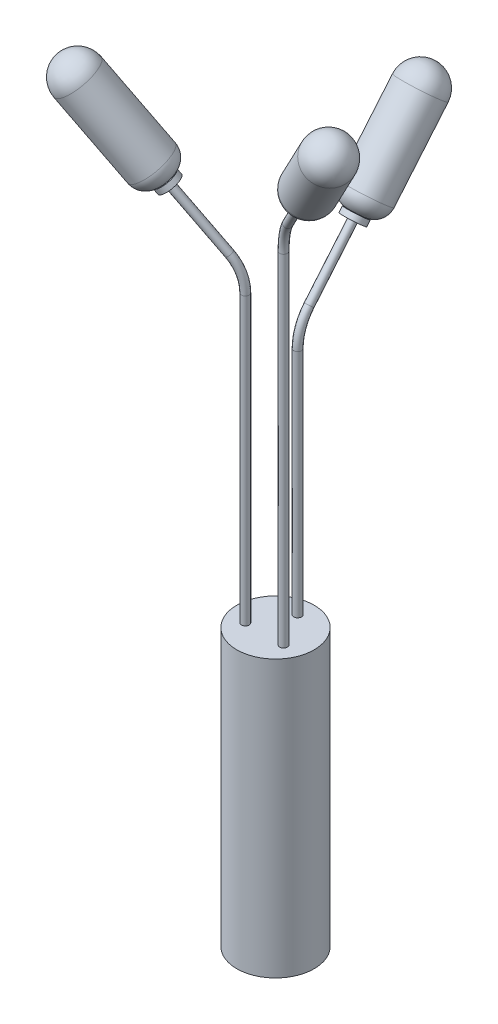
ISO-10303-21;
HEADER;
FILE_DESCRIPTION(('STEP AP214'),'2;1');
FILE_NAME('part.step','',(''),(''),'','','');
FILE_SCHEMA(('AUTOMOTIVE_DESIGN { 1 0 10303 214 1 1 1 1 }'));
ENDSEC;
DATA;
#1=APPLICATION_CONTEXT('core data for automotive mechanical design processes');
#2=APPLICATION_PROTOCOL_DEFINITION('international standard','automotive_design',2000,#1);
#3=PRODUCT_CONTEXT('',#1,'mechanical');
#4=PRODUCT('Part','Part','',(#3));
#5=PRODUCT_RELATED_PRODUCT_CATEGORY('part','',(#4));
#6=PRODUCT_DEFINITION_FORMATION('','',#4);
#7=PRODUCT_DEFINITION_CONTEXT('part definition',#1,'design');
#8=PRODUCT_DEFINITION('design','',#6,#7);
#9=PRODUCT_DEFINITION_SHAPE('','',#8);
#10=(LENGTH_UNIT() NAMED_UNIT(*) SI_UNIT(.MILLI.,.METRE.));
#11=(NAMED_UNIT(*) PLANE_ANGLE_UNIT() SI_UNIT($,.RADIAN.));
#12=(NAMED_UNIT(*) SI_UNIT($,.STERADIAN.) SOLID_ANGLE_UNIT());
#13=UNCERTAINTY_MEASURE_WITH_UNIT(LENGTH_MEASURE(1.E-05),#10,'distance_accuracy_value','');
#14=(GEOMETRIC_REPRESENTATION_CONTEXT(3) GLOBAL_UNCERTAINTY_ASSIGNED_CONTEXT((#13)) GLOBAL_UNIT_ASSIGNED_CONTEXT((#10,
#11,#12)) REPRESENTATION_CONTEXT('',''));
#15=CARTESIAN_POINT('',(0.,0.,0.));
#16=DIRECTION('',(0.,0.,1.));
#17=DIRECTION('',(1.,0.,0.));
#18=AXIS2_PLACEMENT_3D('',#15,#16,#17);
#19=CARTESIAN_POINT('',(-460.359620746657,809.369940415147,1345.9164633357));
#20=DIRECTION('',(-0.556670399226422,0.766044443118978,0.321393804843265));
#21=DIRECTION('',(0.407964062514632,0.589101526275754,-0.697513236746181));
#22=AXIS2_PLACEMENT_3D('',#19,#20,#21);
#23=PLANE('',#22);
#24=CARTESIAN_POINT('',(-460.359620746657,809.369940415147,1345.9164633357));
#25=DIRECTION('',(-0.556670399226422,0.766044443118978,0.321393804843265));
#26=DIRECTION('',(0.407964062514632,0.589101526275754,-0.697513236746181));
#27=AXIS2_PLACEMENT_3D('',#24,#25,#26);
#28=CIRCLE('',#27,20.);
#29=CARTESIAN_POINT('',(-452.200339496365,821.151970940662,1331.96619860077));
#30=VERTEX_POINT('',#29);
#31=EDGE_CURVE('P0_E9',#30,#30,#28,.T.);
#32=ORIENTED_EDGE('',*,*,#31,.T.);
#33=EDGE_LOOP('',(#32));
#34=FACE_BOUND('',#33,.T.);
#35=ADVANCED_FACE('P0_F14',(#34),#23,.T.);
#36=CARTESIAN_POINT('',(-460.359620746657,809.369940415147,1345.9164633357));
#37=DIRECTION('',(-0.556670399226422,0.766044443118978,0.321393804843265));
#38=DIRECTION('',(0.407964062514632,0.589101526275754,-0.697513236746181));
#39=AXIS2_PLACEMENT_3D('',#36,#37,#38);
#40=CYLINDRICAL_SURFACE('',#39,20.);
#41=CARTESIAN_POINT('',(-353.625084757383,662.490569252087,1284.29325025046));
#42=DIRECTION('',(-0.556670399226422,0.766044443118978,0.321393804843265));
#43=DIRECTION('',(0.407964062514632,0.589101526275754,-0.697513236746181));
#44=AXIS2_PLACEMENT_3D('',#41,#42,#43);
#45=CIRCLE('',#44,20.);
#46=CARTESIAN_POINT('',(-345.46580350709,674.272599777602,1270.34298551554));
#47=VERTEX_POINT('',#46);
#48=EDGE_CURVE('P0_E20',#47,#47,#45,.T.);
#49=CARTESIAN_POINT('',(-345.46580350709,674.272599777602,1270.34298551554));
#50=CARTESIAN_POINT('',(-346.577621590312,675.802593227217,1270.98489398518));
#51=CARTESIAN_POINT('',(-347.689439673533,677.332586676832,1271.62680245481));
#52=CARTESIAN_POINT('',(-349.913075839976,680.392573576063,1272.91061939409));
#53=CARTESIAN_POINT('',(-351.024893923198,681.922567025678,1273.55252786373));
#54=CARTESIAN_POINT('',(-353.248530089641,684.982553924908,1274.836344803));
#55=CARTESIAN_POINT('',(-354.360348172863,686.512547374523,1275.47825327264));
#56=CARTESIAN_POINT('',(-356.583984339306,689.572534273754,1276.76207021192));
#57=CARTESIAN_POINT('',(-357.695802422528,691.102527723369,1277.40397868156));
#58=CARTESIAN_POINT('',(-359.919438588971,694.162514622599,1278.68779562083));
#59=CARTESIAN_POINT('',(-361.031256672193,695.692508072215,1279.32970409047));
#60=CARTESIAN_POINT('',(-363.254892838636,698.752494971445,1280.61352102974));
#61=CARTESIAN_POINT('',(-364.366710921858,700.28248842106,1281.25542949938));
#62=CARTESIAN_POINT('',(-366.590347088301,703.342475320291,1282.53924643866));
#63=CARTESIAN_POINT('',(-367.702165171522,704.872468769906,1283.1811549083));
#64=CARTESIAN_POINT('',(-369.925801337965,707.932455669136,1284.46497184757));
#65=CARTESIAN_POINT('',(-371.037619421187,709.462449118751,1285.10688031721));
#66=CARTESIAN_POINT('',(-373.26125558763,712.522436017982,1286.39069725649));
#67=CARTESIAN_POINT('',(-374.373073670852,714.052429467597,1287.03260572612));
#68=CARTESIAN_POINT('',(-376.596709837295,717.112416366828,1288.3164226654));
#69=CARTESIAN_POINT('',(-377.708527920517,718.642409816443,1288.95833113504));
#70=CARTESIAN_POINT('',(-379.93216408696,721.702396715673,1290.24214807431));
#71=CARTESIAN_POINT('',(-381.043982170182,723.232390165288,1290.88405654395));
#72=CARTESIAN_POINT('',(-383.267618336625,726.292377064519,1292.16787348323));
#73=CARTESIAN_POINT('',(-384.379436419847,727.822370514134,1292.80978195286));
#74=CARTESIAN_POINT('',(-386.60307258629,730.882357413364,1294.09359889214));
#75=CARTESIAN_POINT('',(-387.714890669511,732.41235086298,1294.73550736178));
#76=CARTESIAN_POINT('',(-389.938526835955,735.47233776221,1296.01932430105));
#77=CARTESIAN_POINT('',(-391.050344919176,737.002331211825,1296.66123277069));
#78=CARTESIAN_POINT('',(-393.273981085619,740.062318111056,1297.94504970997));
#79=CARTESIAN_POINT('',(-394.385799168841,741.592311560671,1298.58695817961));
#80=CARTESIAN_POINT('',(-396.609435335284,744.652298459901,1299.87077511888));
#81=CARTESIAN_POINT('',(-397.721253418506,746.182291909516,1300.51268358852));
#82=CARTESIAN_POINT('',(-399.944889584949,749.242278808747,1301.79650052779));
#83=CARTESIAN_POINT('',(-401.056707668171,750.772272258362,1302.43840899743));
#84=CARTESIAN_POINT('',(-403.280343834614,753.832259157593,1303.72222593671));
#85=CARTESIAN_POINT('',(-404.392161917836,755.362252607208,1304.36413440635));
#86=CARTESIAN_POINT('',(-406.615798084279,758.422239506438,1305.64795134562));
#87=CARTESIAN_POINT('',(-407.7276161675,759.952232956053,1306.28985981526));
#88=CARTESIAN_POINT('',(-409.951252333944,763.012219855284,1307.57367675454));
#89=CARTESIAN_POINT('',(-411.063070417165,764.542213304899,1308.21558522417));
#90=CARTESIAN_POINT('',(-413.286706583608,767.602200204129,1309.49940216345));
#91=CARTESIAN_POINT('',(-414.39852466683,769.132193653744,1310.14131063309));
#92=CARTESIAN_POINT('',(-416.622160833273,772.192180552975,1311.42512757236));
#93=CARTESIAN_POINT('',(-417.733978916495,773.72217400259,1312.067036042));
#94=CARTESIAN_POINT('',(-419.957615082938,776.782160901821,1313.35085298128));
#95=CARTESIAN_POINT('',(-421.06943316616,778.312154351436,1313.99276145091));
#96=CARTESIAN_POINT('',(-423.293069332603,781.372141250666,1315.27657839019));
#97=CARTESIAN_POINT('',(-424.404887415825,782.902134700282,1315.91848685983));
#98=CARTESIAN_POINT('',(-426.628523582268,785.962121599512,1317.2023037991));
#99=CARTESIAN_POINT('',(-427.740341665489,787.492115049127,1317.84421226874));
#100=CARTESIAN_POINT('',(-429.963977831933,790.552101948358,1319.12802920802));
#101=CARTESIAN_POINT('',(-431.075795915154,792.082095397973,1319.76993767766));
#102=CARTESIAN_POINT('',(-433.299432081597,795.142082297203,1321.05375461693));
#103=CARTESIAN_POINT('',(-434.411250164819,796.672075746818,1321.69566308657));
#104=CARTESIAN_POINT('',(-436.634886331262,799.732062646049,1322.97948002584));
#105=CARTESIAN_POINT('',(-437.746704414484,801.262056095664,1323.62138849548));
#106=CARTESIAN_POINT('',(-439.970340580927,804.322042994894,1324.90520543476));
#107=CARTESIAN_POINT('',(-441.082158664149,805.85203644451,1325.5471139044));
#108=CARTESIAN_POINT('',(-443.305794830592,808.91202334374,1326.83093084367));
#109=CARTESIAN_POINT('',(-444.417612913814,810.442016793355,1327.47283931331));
#110=CARTESIAN_POINT('',(-446.641249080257,813.502003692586,1328.75665625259));
#111=CARTESIAN_POINT('',(-447.753067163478,815.031997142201,1329.39856472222));
#112=CARTESIAN_POINT('',(-449.976703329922,818.091984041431,1330.6823816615));
#113=CARTESIAN_POINT('',(-451.088521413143,819.621977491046,1331.32429013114));
#114=CARTESIAN_POINT('',(-452.200339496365,821.151970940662,1331.96619860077));
#115=B_SPLINE_CURVE_WITH_KNOTS('',3,(#49,#50,#51,#52,#53,#54,#55,#56,#57,#58,#59,#60,#61,#62,
#63,#64,#65,#66,#67,#68,#69,#70,#71,#72,#73,#74,#75,#76,#77,#78,#79,#80,#81,#82,#83,#84,#85,#86,
#87,#88,#89,#90,#91,#92,#93,#94,#95,#96,#97,#98,#99,#100,#101,#102,#103,#104,#105,#106,#107,
#108,#109,#110,#111,#112,#113,#114),.UNSPECIFIED.,.F.,.F.,(4,2,2,2,2,2,2,2,2,2,2,2,2,2,2,2,2,2,
2,2,2,2,2,2,2,2,2,2,2,2,2,2,4),(0.,5.99179380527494,11.98358761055,17.975381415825,
23.9671752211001,29.958969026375,35.95076283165,41.942556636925,47.9343504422,53.9261442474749,
59.91793805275,65.9097318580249,71.9015256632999,77.8933194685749,83.8851132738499,
89.8769070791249,95.8687008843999,101.860494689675,107.85228849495,113.844082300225,
119.8358761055,125.827669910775,131.81946371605,137.811257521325,143.8030513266,
149.794845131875,155.78663893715,161.778432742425,167.7702265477,173.762020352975,
179.75381415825,185.745607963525,191.7374017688),.UNSPECIFIED.);
#116=EDGE_CURVE('P0_BSEAM26',#47,#30,#115,.T.);
#117=ORIENTED_EDGE('',*,*,#48,.T.);
#118=ORIENTED_EDGE('',*,*,#31,.F.);
#119=ORIENTED_EDGE('',*,*,#116,.T.);
#120=ORIENTED_EDGE('',*,*,#116,.F.);
#121=EDGE_LOOP('',(#117,#119,#118,#120));
#122=FACE_BOUND('',#121,.T.);
#123=ADVANCED_FACE('P0_F26',(#122),#40,.T.);
#124=CARTESIAN_POINT('',(-368.098279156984,657.3472122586,1271.48417055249));
#125=DIRECTION('',(0.556670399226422,-0.766044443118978,-0.321393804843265));
#126=DIRECTION('',(-0.407964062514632,-0.589101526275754,0.697513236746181));
#127=AXIS2_PLACEMENT_3D('',#124,#125,#126);
#128=PLANE('',#127);
#129=ORIENTED_EDGE('',*,*,#48,.F.);
#130=EDGE_LOOP('',(#129));
#131=FACE_BOUND('',#130,.T.);
#132=ADVANCED_FACE('P0_F29',(#131),#128,.T.);
#133=CLOSED_SHELL('',(#35,#123,#132));
#134=MANIFOLD_SOLID_BREP('P0_B1',#133);
#135=CARTESIAN_POINT('',(-342.797113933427,647.589998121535,1278.04171838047));
#136=DIRECTION('',(-0.556670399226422,0.766044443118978,0.321393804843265));
#137=DIRECTION('',(0.407964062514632,0.589101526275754,-0.697513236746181));
#138=AXIS2_PLACEMENT_3D('',#135,#136,#137);
#139=CYLINDRICAL_SURFACE('',#138,20.);
#140=CARTESIAN_POINT('',(-342.797113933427,647.589998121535,1278.04171838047));
#141=DIRECTION('',(0.556670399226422,-0.766044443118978,-0.321393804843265));
#142=DIRECTION('',(-0.407964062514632,-0.589101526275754,0.697513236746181));
#143=AXIS2_PLACEMENT_3D('',#140,#141,#142);
#144=CIRCLE('',#143,20.);
#145=CARTESIAN_POINT('',(-334.637832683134,659.37202864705,1264.09145364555));
#146=VERTEX_POINT('',#145);
#147=EDGE_CURVE('P1_E10',#146,#146,#144,.T.);
#148=CARTESIAN_POINT('',(-348.363817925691,655.250442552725,1281.25565642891));
#149=DIRECTION('',(0.556670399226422,-0.766044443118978,-0.321393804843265));
#150=DIRECTION('',(-0.407964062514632,-0.589101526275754,0.697513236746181));
#151=AXIS2_PLACEMENT_3D('',#148,#149,#150);
#152=CIRCLE('',#151,20.);
#153=CARTESIAN_POINT('',(-340.204536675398,667.03247307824,1267.30539169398));
#154=VERTEX_POINT('',#153);
#155=EDGE_CURVE('P1_E18',#154,#154,#152,.T.);
#156=CARTESIAN_POINT('',(-334.637832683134,659.37202864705,1264.09145364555));
#157=CARTESIAN_POINT('',(-334.695819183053,659.451824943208,1264.12493216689));
#158=CARTESIAN_POINT('',(-334.753805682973,659.531621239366,1264.15841068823));
#159=CARTESIAN_POINT('',(-334.869778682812,659.691213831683,1264.2253677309));
#160=CARTESIAN_POINT('',(-334.927765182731,659.771010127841,1264.25884625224));
#161=CARTESIAN_POINT('',(-335.04373818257,659.930602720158,1264.32580329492));
#162=CARTESIAN_POINT('',(-335.101724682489,660.010399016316,1264.35928181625));
#163=CARTESIAN_POINT('',(-335.217697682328,660.169991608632,1264.42623885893));
#164=CARTESIAN_POINT('',(-335.275684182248,660.249787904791,1264.45971738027));
#165=CARTESIAN_POINT('',(-335.391657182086,660.409380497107,1264.52667442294));
#166=CARTESIAN_POINT('',(-335.449643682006,660.489176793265,1264.56015294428));
#167=CARTESIAN_POINT('',(-335.565616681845,660.648769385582,1264.62710998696));
#168=CARTESIAN_POINT('',(-335.623603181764,660.72856568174,1264.66058850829));
#169=CARTESIAN_POINT('',(-335.739576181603,660.888158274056,1264.72754555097));
#170=CARTESIAN_POINT('',(-335.797562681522,660.967954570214,1264.76102407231));
#171=CARTESIAN_POINT('',(-335.913535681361,661.127547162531,1264.82798111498));
#172=CARTESIAN_POINT('',(-335.971522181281,661.207343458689,1264.86145963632));
#173=CARTESIAN_POINT('',(-336.087495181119,661.366936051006,1264.928416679));
#174=CARTESIAN_POINT('',(-336.145481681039,661.446732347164,1264.96189520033));
#175=CARTESIAN_POINT('',(-336.261454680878,661.60632493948,1265.02885224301));
#176=CARTESIAN_POINT('',(-336.319441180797,661.686121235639,1265.06233076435));
#177=CARTESIAN_POINT('',(-336.435414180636,661.845713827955,1265.12928780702));
#178=CARTESIAN_POINT('',(-336.493400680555,661.925510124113,1265.16276632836));
#179=CARTESIAN_POINT('',(-336.609373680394,662.08510271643,1265.22972337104));
#180=CARTESIAN_POINT('',(-336.667360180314,662.164899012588,1265.26320189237));
#181=CARTESIAN_POINT('',(-336.783333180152,662.324491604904,1265.33015893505));
#182=CARTESIAN_POINT('',(-336.841319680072,662.404287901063,1265.36363745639));
#183=CARTESIAN_POINT('',(-336.957292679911,662.563880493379,1265.43059449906));
#184=CARTESIAN_POINT('',(-337.01527917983,662.643676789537,1265.4640730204));
#185=CARTESIAN_POINT('',(-337.131252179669,662.803269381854,1265.53103006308));
#186=CARTESIAN_POINT('',(-337.189238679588,662.883065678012,1265.56450858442));
#187=CARTESIAN_POINT('',(-337.305211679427,663.042658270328,1265.63146562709));
#188=CARTESIAN_POINT('',(-337.363198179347,663.122454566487,1265.66494414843));
#189=CARTESIAN_POINT('',(-337.479171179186,663.282047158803,1265.7319011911));
#190=CARTESIAN_POINT('',(-337.537157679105,663.361843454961,1265.76537971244));
#191=CARTESIAN_POINT('',(-337.653130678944,663.521436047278,1265.83233675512));
#192=CARTESIAN_POINT('',(-337.711117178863,663.601232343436,1265.86581527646));
#193=CARTESIAN_POINT('',(-337.827090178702,663.760824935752,1265.93277231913));
#194=CARTESIAN_POINT('',(-337.885076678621,663.840621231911,1265.96625084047));
#195=CARTESIAN_POINT('',(-338.00104967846,664.000213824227,1266.03320788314));
#196=CARTESIAN_POINT('',(-338.05903617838,664.080010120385,1266.06668640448));
#197=CARTESIAN_POINT('',(-338.175009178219,664.239602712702,1266.13364344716));
#198=CARTESIAN_POINT('',(-338.232995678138,664.31939900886,1266.1671219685));
#199=CARTESIAN_POINT('',(-338.348968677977,664.478991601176,1266.23407901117));
#200=CARTESIAN_POINT('',(-338.406955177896,664.558787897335,1266.26755753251));
#201=CARTESIAN_POINT('',(-338.522928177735,664.718380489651,1266.33451457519));
#202=CARTESIAN_POINT('',(-338.580914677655,664.798176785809,1266.36799309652));
#203=CARTESIAN_POINT('',(-338.696887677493,664.957769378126,1266.4349501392));
#204=CARTESIAN_POINT('',(-338.754874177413,665.037565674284,1266.46842866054));
#205=CARTESIAN_POINT('',(-338.870847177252,665.197158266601,1266.53538570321));
#206=CARTESIAN_POINT('',(-338.928833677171,665.276954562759,1266.56886422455));
#207=CARTESIAN_POINT('',(-339.04480667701,665.436547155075,1266.63582126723));
#208=CARTESIAN_POINT('',(-339.102793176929,665.516343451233,1266.66929978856));
#209=CARTESIAN_POINT('',(-339.218766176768,665.67593604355,1266.73625683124));
#210=CARTESIAN_POINT('',(-339.276752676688,665.755732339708,1266.76973535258));
#211=CARTESIAN_POINT('',(-339.392725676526,665.915324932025,1266.83669239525));
#212=CARTESIAN_POINT('',(-339.450712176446,665.995121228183,1266.87017091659));
#213=CARTESIAN_POINT('',(-339.566685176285,666.154713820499,1266.93712795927));
#214=CARTESIAN_POINT('',(-339.624671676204,666.234510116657,1266.9706064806));
#215=CARTESIAN_POINT('',(-339.740644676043,666.394102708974,1267.03756352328));
#216=CARTESIAN_POINT('',(-339.798631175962,666.473899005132,1267.07104204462));
#217=CARTESIAN_POINT('',(-339.914604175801,666.633491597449,1267.13799908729));
#218=CARTESIAN_POINT('',(-339.972590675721,666.713287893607,1267.17147760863));
#219=CARTESIAN_POINT('',(-340.088563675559,666.872880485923,1267.23843465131));
#220=CARTESIAN_POINT('',(-340.146550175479,666.952676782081,1267.27191317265));
#221=CARTESIAN_POINT('',(-340.204536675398,667.03247307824,1267.30539169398));
#222=B_SPLINE_CURVE_WITH_KNOTS('',3,(#156,#157,#158,#159,#160,#161,#162,#163,#164,#165,#166,
#167,#168,#169,#170,#171,#172,#173,#174,#175,#176,#177,#178,#179,#180,#181,#182,#183,#184,#185,
#186,#187,#188,#189,#190,#191,#192,#193,#194,#195,#196,#197,#198,#199,#200,#201,#202,#203,#204,
#205,#206,#207,#208,#209,#210,#211,#212,#213,#214,#215,#216,#217,#218,#219,#220,#221),
.UNSPECIFIED.,.F.,.F.,(4,2,2,2,2,2,2,2,2,2,2,2,2,2,2,2,2,2,2,2,2,2,2,2,2,2,2,2,2,2,2,2,4),(0.,
0.312500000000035,0.624999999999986,0.937500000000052,1.25,1.56249999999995,1.87500000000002,
2.18749999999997,2.5,2.81249999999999,3.12499999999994,3.4375,3.74999999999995,4.06250000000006,
4.37500000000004,4.68750000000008,5.00000000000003,5.31250000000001,5.62500000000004,
5.93749999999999,6.25000000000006,6.56250000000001,6.87499999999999,7.18750000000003,
7.49999999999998,7.81250000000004,8.12499999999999,8.43749999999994,8.75000000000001,
9.06249999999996,9.37500000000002,9.68749999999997,10.),.UNSPECIFIED.);
#223=EDGE_CURVE('P1_BSEAM15',#146,#154,#222,.T.);
#224=ORIENTED_EDGE('',*,*,#147,.F.);
#225=ORIENTED_EDGE('',*,*,#155,.T.);
#226=ORIENTED_EDGE('',*,*,#223,.T.);
#227=ORIENTED_EDGE('',*,*,#223,.F.);
#228=EDGE_LOOP('',(#224,#226,#225,#227));
#229=FACE_BOUND('',#228,.T.);
#230=ADVANCED_FACE('P1_F15',(#229),#139,.T.);
#231=CARTESIAN_POINT('',(-342.797113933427,647.589998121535,1278.04171838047));
#232=DIRECTION('',(0.556670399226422,-0.766044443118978,-0.321393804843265));
#233=DIRECTION('',(-0.407964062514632,-0.589101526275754,0.697513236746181));
#234=AXIS2_PLACEMENT_3D('',#231,#232,#233);
#235=PLANE('',#234);
#236=ORIENTED_EDGE('',*,*,#147,.T.);
#237=EDGE_LOOP('',(#236));
#238=FACE_BOUND('',#237,.T.);
#239=ADVANCED_FACE('P1_F30',(#238),#235,.T.);
#240=CARTESIAN_POINT('',(-348.363817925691,655.250442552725,1281.25565642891));
#241=DIRECTION('',(0.556670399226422,-0.766044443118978,-0.321393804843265));
#242=DIRECTION('',(-0.407964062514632,-0.589101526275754,0.697513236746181));
#243=AXIS2_PLACEMENT_3D('',#240,#241,#242);
#244=PLANE('',#243);
#245=ORIENTED_EDGE('',*,*,#155,.F.);
#246=EDGE_LOOP('',(#245));
#247=FACE_BOUND('',#246,.T.);
#248=ADVANCED_FACE('P1_F28',(#247),#244,.F.);
#249=CLOSED_SHELL('',(#230,#239,#248));
#250=MANIFOLD_SOLID_BREP('P1_B1',#249);
#251=CARTESIAN_POINT('',(-448.564489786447,793.138442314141,1339.10654130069));
#252=DIRECTION('',(-0.556670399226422,0.766044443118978,0.321393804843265));
#253=DIRECTION('',(0.723659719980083,0.257167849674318,0.640453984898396));
#254=AXIS2_PLACEMENT_3D('',#251,#252,#253);
#255=SPHERICAL_SURFACE('',#254,40.);
#256=CARTESIAN_POINT('',(-448.564489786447,793.138442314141,1339.10654130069));
#257=DIRECTION('',(-0.556670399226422,0.766044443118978,0.321393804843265));
#258=DIRECTION('',(0.407964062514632,0.589101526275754,-0.697513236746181));
#259=AXIS2_PLACEMENT_3D('',#256,#257,#258);
#260=CIRCLE('',#259,40.);
#261=CARTESIAN_POINT('',(-432.245927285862,816.702503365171,1311.20601183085));
#262=VERTEX_POINT('',#261);
#263=EDGE_CURVE('P2_E39',#262,#262,#260,.T.);
#264=ORIENTED_EDGE('',*,*,#263,.T.);
#265=EDGE_LOOP('',(#264));
#266=FACE_BOUND('',#265,.T.);
#267=ADVANCED_FACE('P2_F16',(#266),#255,.T.);
#268=CARTESIAN_POINT('',(-348.363817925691,655.250442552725,1281.25565642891));
#269=DIRECTION('',(-0.556670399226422,0.766044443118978,0.321393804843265));
#270=DIRECTION('',(0.407964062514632,0.589101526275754,-0.697513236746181));
#271=AXIS2_PLACEMENT_3D('',#268,#269,#270);
#272=PLANE('',#271);
#273=CARTESIAN_POINT('',(-348.363817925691,655.250442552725,1281.25565642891));
#274=DIRECTION('',(-0.556670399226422,0.766044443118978,0.321393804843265));
#275=DIRECTION('',(0.407964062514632,0.589101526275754,-0.697513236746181));
#276=AXIS2_PLACEMENT_3D('',#273,#274,#275);
#277=CIRCLE('',#276,12.1875);
#278=CARTESIAN_POINT('',(-343.391755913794,662.43011740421,1272.75471385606));
#279=VERTEX_POINT('',#278);
#280=EDGE_CURVE('P2_E31',#279,#279,#277,.T.);
#281=ORIENTED_EDGE('',*,*,#280,.F.);
#282=EDGE_LOOP('',(#281));
#283=FACE_BOUND('',#282,.T.);
#284=ADVANCED_FACE('P2_F53',(#283),#272,.F.);
#285=CARTESIAN_POINT('',(-363.846213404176,676.556053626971,1290.19442162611));
#286=DIRECTION('',(-0.556670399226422,0.766044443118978,0.321393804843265));
#287=DIRECTION('',(0.407964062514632,0.589101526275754,-0.697513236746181));
#288=AXIS2_PLACEMENT_3D('',#285,#286,#287);
#289=DEGENERATE_TOROIDAL_SURFACE('',#288,12.1875,27.8125,.T.);
#290=CARTESIAN_POINT('',(-363.846213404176,676.556053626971,1290.19442162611));
#291=DIRECTION('',(-0.556670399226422,0.766044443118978,0.321393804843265));
#292=DIRECTION('',(0.407964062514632,0.589101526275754,-0.697513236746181));
#293=AXIS2_PLACEMENT_3D('',#290,#291,#292);
#294=CIRCLE('',#293,40.);
#295=CARTESIAN_POINT('',(-347.52765090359,700.120114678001,1262.29389215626));
#296=VERTEX_POINT('',#295);
#297=EDGE_CURVE('P2_E36',#296,#296,#294,.T.);
#298=ORIENTED_EDGE('',*,*,#297,.F.);
#299=EDGE_LOOP('',(#298));
#300=FACE_BOUND('',#299,.T.);
#301=ORIENTED_EDGE('',*,*,#280,.T.);
#302=EDGE_LOOP('',(#301));
#303=FACE_BOUND('',#302,.T.);
#304=ADVANCED_FACE('P2_F47',(#300,#303),#289,.T.);
#305=CARTESIAN_POINT('',(-470.831305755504,823.7802200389,1351.96229349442));
#306=DIRECTION('',(-0.556670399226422,0.766044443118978,0.321393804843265));
#307=DIRECTION('',(0.407964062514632,0.589101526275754,-0.697513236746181));
#308=AXIS2_PLACEMENT_3D('',#305,#306,#307);
#309=CYLINDRICAL_SURFACE('',#308,40.);
#310=CARTESIAN_POINT('',(-432.245927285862,816.702503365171,1311.20601183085));
#311=CARTESIAN_POINT('',(-431.363445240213,815.488103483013,1310.69651058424));
#312=CARTESIAN_POINT('',(-430.480963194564,814.273703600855,1310.18700933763));
#313=CARTESIAN_POINT('',(-428.715999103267,811.844903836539,1309.16800684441));
#314=CARTESIAN_POINT('',(-427.833517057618,810.630503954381,1308.6585055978));
#315=CARTESIAN_POINT('',(-426.068552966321,808.201704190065,1307.63950310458));
#316=CARTESIAN_POINT('',(-425.186070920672,806.987304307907,1307.13000185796));
#317=CARTESIAN_POINT('',(-423.421106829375,804.558504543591,1306.11099936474));
#318=CARTESIAN_POINT('',(-422.538624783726,803.344104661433,1305.60149811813));
#319=CARTESIAN_POINT('',(-420.773660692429,800.915304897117,1304.58249562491));
#320=CARTESIAN_POINT('',(-419.89117864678,799.700905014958,1304.0729943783));
#321=CARTESIAN_POINT('',(-418.126214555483,797.272105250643,1303.05399188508));
#322=CARTESIAN_POINT('',(-417.243732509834,796.057705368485,1302.54449063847));
#323=CARTESIAN_POINT('',(-415.478768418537,793.628905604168,1301.52548814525));
#324=CARTESIAN_POINT('',(-414.596286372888,792.41450572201,1301.01598689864));
#325=CARTESIAN_POINT('',(-412.831322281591,789.985705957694,1299.99698440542));
#326=CARTESIAN_POINT('',(-411.948840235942,788.771306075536,1299.48748315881));
#327=CARTESIAN_POINT('',(-410.183876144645,786.342506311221,1298.46848066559));
#328=CARTESIAN_POINT('',(-409.301394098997,785.128106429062,1297.95897941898));
#329=CARTESIAN_POINT('',(-407.536430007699,782.699306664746,1296.93997692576));
#330=CARTESIAN_POINT('',(-406.653947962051,781.484906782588,1296.43047567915));
#331=CARTESIAN_POINT('',(-404.888983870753,779.056107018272,1295.41147318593));
#332=CARTESIAN_POINT('',(-404.006501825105,777.841707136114,1294.90197193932));
#333=CARTESIAN_POINT('',(-402.241537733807,775.412907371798,1293.8829694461));
#334=CARTESIAN_POINT('',(-401.359055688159,774.19850748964,1293.37346819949));
#335=CARTESIAN_POINT('',(-399.594091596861,771.769707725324,1292.35446570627));
#336=CARTESIAN_POINT('',(-398.711609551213,770.555307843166,1291.84496445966));
#337=CARTESIAN_POINT('',(-396.946645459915,768.12650807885,1290.82596196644));
#338=CARTESIAN_POINT('',(-396.064163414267,766.912108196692,1290.31646071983));
#339=CARTESIAN_POINT('',(-394.299199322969,764.483308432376,1289.29745822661));
#340=CARTESIAN_POINT('',(-393.416717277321,763.268908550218,1288.78795698));
#341=CARTESIAN_POINT('',(-391.651753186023,760.840108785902,1287.76895448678));
#342=CARTESIAN_POINT('',(-390.769271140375,759.625708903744,1287.25945324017));
#343=CARTESIAN_POINT('',(-389.004307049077,757.196909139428,1286.24045074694));
#344=CARTESIAN_POINT('',(-388.121825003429,755.98250925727,1285.73094950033));
#345=CARTESIAN_POINT('',(-386.356860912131,753.553709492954,1284.71194700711));
#346=CARTESIAN_POINT('',(-385.474378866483,752.339309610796,1284.2024457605));
#347=CARTESIAN_POINT('',(-383.709414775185,749.91050984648,1283.18344326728));
#348=CARTESIAN_POINT('',(-382.826932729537,748.696109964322,1282.67394202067));
#349=CARTESIAN_POINT('',(-381.061968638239,746.267310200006,1281.65493952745));
#350=CARTESIAN_POINT('',(-380.179486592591,745.052910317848,1281.14543828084));
#351=CARTESIAN_POINT('',(-378.414522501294,742.624110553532,1280.12643578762));
#352=CARTESIAN_POINT('',(-377.532040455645,741.409710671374,1279.61693454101));
#353=CARTESIAN_POINT('',(-375.767076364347,738.980910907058,1278.59793204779));
#354=CARTESIAN_POINT('',(-374.884594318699,737.7665110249,1278.08843080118));
#355=CARTESIAN_POINT('',(-373.119630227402,735.337711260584,1277.06942830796));
#356=CARTESIAN_POINT('',(-372.237148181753,734.123311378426,1276.55992706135));
#357=CARTESIAN_POINT('',(-370.472184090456,731.69451161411,1275.54092456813));
#358=CARTESIAN_POINT('',(-369.589702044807,730.480111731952,1275.03142332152));
#359=CARTESIAN_POINT('',(-367.82473795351,728.051311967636,1274.0124208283));
#360=CARTESIAN_POINT('',(-366.942255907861,726.836912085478,1273.50291958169));
#361=CARTESIAN_POINT('',(-365.177291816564,724.408112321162,1272.48391708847));
#362=CARTESIAN_POINT('',(-364.294809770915,723.193712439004,1271.97441584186));
#363=CARTESIAN_POINT('',(-362.529845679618,720.764912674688,1270.95541334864));
#364=CARTESIAN_POINT('',(-361.647363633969,719.55051279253,1270.44591210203));
#365=CARTESIAN_POINT('',(-359.882399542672,717.121713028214,1269.42690960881));
#366=CARTESIAN_POINT('',(-358.999917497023,715.907313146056,1268.9174083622));
#367=CARTESIAN_POINT('',(-357.234953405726,713.47851338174,1267.89840586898));
#368=CARTESIAN_POINT('',(-356.352471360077,712.264113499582,1267.38890462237));
#369=CARTESIAN_POINT('',(-354.58750726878,709.835313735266,1266.36990212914));
#370=CARTESIAN_POINT('',(-353.705025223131,708.620913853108,1265.86040088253));
#371=CARTESIAN_POINT('',(-351.940061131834,706.192114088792,1264.84139838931));
#372=CARTESIAN_POINT('',(-351.057579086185,704.977714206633,1264.3318971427));
#373=CARTESIAN_POINT('',(-349.292614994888,702.548914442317,1263.31289464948));
#374=CARTESIAN_POINT('',(-348.410132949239,701.334514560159,1262.80339340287));
#375=CARTESIAN_POINT('',(-347.52765090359,700.120114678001,1262.29389215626));
#376=B_SPLINE_CURVE_WITH_KNOTS('',3,(#310,#311,#312,#313,#314,#315,#316,#317,#318,#319,#320,
#321,#322,#323,#324,#325,#326,#327,#328,#329,#330,#331,#332,#333,#334,#335,#336,#337,#338,#339,
#340,#341,#342,#343,#344,#345,#346,#347,#348,#349,#350,#351,#352,#353,#354,#355,#356,#357,#358,
#359,#360,#361,#362,#363,#364,#365,#366,#367,#368,#369,#370,#371,#372,#373,#374,#375),
.UNSPECIFIED.,.F.,.F.,(4,2,2,2,2,2,2,2,2,2,2,2,2,2,2,2,2,2,2,2,2,2,2,2,2,2,2,2,2,2,2,2,4),(0.,
4.755859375,9.51171875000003,14.2675781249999,19.0234374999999,23.779296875,28.53515625,
33.291015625,38.0468749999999,42.802734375,47.55859375,52.3144531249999,57.0703124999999,
61.826171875,66.58203125,71.337890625,76.09375,80.8496093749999,85.60546875,90.3613281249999,
95.1171874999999,99.873046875,104.62890625,109.384765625,114.140625,118.896484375,123.65234375,
128.408203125,133.1640625,137.919921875,142.67578125,147.431640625,152.1875),.UNSPECIFIED.);
#377=EDGE_CURVE('P2_BSEAM44',#262,#296,#376,.T.);
#378=ORIENTED_EDGE('',*,*,#263,.F.);
#379=ORIENTED_EDGE('',*,*,#297,.T.);
#380=ORIENTED_EDGE('',*,*,#377,.T.);
#381=ORIENTED_EDGE('',*,*,#377,.F.);
#382=EDGE_LOOP('',(#378,#380,#379,#381));
#383=FACE_BOUND('',#382,.T.);
#384=ADVANCED_FACE('P2_F44',(#383),#309,.T.);
#385=CLOSED_SHELL('',(#267,#284,#304,#384));
#386=CARTESIAN_POINT('',(-448.564489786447,793.138442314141,1339.10654130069));
#387=DIRECTION('',(-0.556670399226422,0.766044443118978,0.321393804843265));
#388=DIRECTION('',(0.723659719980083,0.257167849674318,0.640453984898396));
#389=AXIS2_PLACEMENT_3D('',#386,#387,#388);
#390=SPHERICAL_SURFACE('',#389,38.);
#391=CARTESIAN_POINT('',(-448.564489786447,793.138442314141,1339.10654130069));
#392=DIRECTION('',(-0.556670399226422,0.766044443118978,0.321393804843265));
#393=DIRECTION('',(0.407964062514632,0.589101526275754,-0.697513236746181));
#394=AXIS2_PLACEMENT_3D('',#391,#392,#393);
#395=CIRCLE('',#394,38.);
#396=CARTESIAN_POINT('',(-433.061855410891,815.524300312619,1312.60103830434));
#397=VERTEX_POINT('',#396);
#398=EDGE_CURVE('P2_E10',#397,#397,#395,.T.);
#399=ORIENTED_EDGE('',*,*,#398,.F.);
#400=EDGE_LOOP('',(#399));
#401=FACE_BOUND('',#400,.T.);
#402=ADVANCED_FACE('P2_F75',(#401),#390,.F.);
#403=CARTESIAN_POINT('',(-470.831305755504,823.7802200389,1351.96229349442));
#404=DIRECTION('',(-0.556670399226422,0.766044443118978,0.321393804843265));
#405=DIRECTION('',(0.407964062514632,0.589101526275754,-0.697513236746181));
#406=AXIS2_PLACEMENT_3D('',#403,#404,#405);
#407=CYLINDRICAL_SURFACE('',#406,38.);
#408=CARTESIAN_POINT('',(-363.846213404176,676.556053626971,1290.19442162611));
#409=DIRECTION('',(-0.556670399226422,0.766044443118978,0.321393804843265));
#410=DIRECTION('',(0.407964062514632,0.589101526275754,-0.697513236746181));
#411=AXIS2_PLACEMENT_3D('',#408,#409,#410);
#412=CIRCLE('',#411,38.);
#413=CARTESIAN_POINT('',(-348.34357902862,698.94191162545,1263.68891862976));
#414=VERTEX_POINT('',#413);
#415=EDGE_CURVE('P2_E23',#414,#414,#412,.T.);
#416=CARTESIAN_POINT('',(-348.34357902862,698.94191162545,1263.68891862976));
#417=CARTESIAN_POINT('',(-349.226061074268,700.156311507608,1264.19841987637));
#418=CARTESIAN_POINT('',(-350.108543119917,701.370711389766,1264.70792112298));
#419=CARTESIAN_POINT('',(-351.873507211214,703.799511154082,1265.7269236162));
#420=CARTESIAN_POINT('',(-352.755989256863,705.01391103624,1266.23642486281));
#421=CARTESIAN_POINT('',(-354.52095334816,707.442710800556,1267.25542735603));
#422=CARTESIAN_POINT('',(-355.403435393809,708.657110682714,1267.76492860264));
#423=CARTESIAN_POINT('',(-357.168399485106,711.08591044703,1268.78393109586));
#424=CARTESIAN_POINT('',(-358.050881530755,712.300310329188,1269.29343234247));
#425=CARTESIAN_POINT('',(-359.815845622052,714.729110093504,1270.31243483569));
#426=CARTESIAN_POINT('',(-360.698327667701,715.943509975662,1270.8219360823));
#427=CARTESIAN_POINT('',(-362.463291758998,718.372309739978,1271.84093857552));
#428=CARTESIAN_POINT('',(-363.345773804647,719.586709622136,1272.35043982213));
#429=CARTESIAN_POINT('',(-365.110737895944,722.015509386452,1273.36944231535));
#430=CARTESIAN_POINT('',(-365.993219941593,723.22990926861,1273.87894356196));
#431=CARTESIAN_POINT('',(-367.75818403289,725.658709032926,1274.89794605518));
#432=CARTESIAN_POINT('',(-368.640666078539,726.873108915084,1275.40744730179));
#433=CARTESIAN_POINT('',(-370.405630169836,729.3019086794,1276.42644979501));
#434=CARTESIAN_POINT('',(-371.288112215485,730.516308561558,1276.93595104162));
#435=CARTESIAN_POINT('',(-373.053076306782,732.945108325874,1277.95495353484));
#436=CARTESIAN_POINT('',(-373.935558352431,734.159508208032,1278.46445478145));
#437=CARTESIAN_POINT('',(-375.700522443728,736.588307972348,1279.48345727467));
#438=CARTESIAN_POINT('',(-376.583004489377,737.802707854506,1279.99295852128));
#439=CARTESIAN_POINT('',(-378.347968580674,740.231507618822,1281.0119610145));
#440=CARTESIAN_POINT('',(-379.230450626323,741.44590750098,1281.52146226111));
#441=CARTESIAN_POINT('',(-380.99541471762,743.874707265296,1282.54046475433));
#442=CARTESIAN_POINT('',(-381.877896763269,745.089107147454,1283.04996600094));
#443=CARTESIAN_POINT('',(-383.642860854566,747.51790691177,1284.06896849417));
#444=CARTESIAN_POINT('',(-384.525342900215,748.732306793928,1284.57846974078));
#445=CARTESIAN_POINT('',(-386.290306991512,751.161106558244,1285.597472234));
#446=CARTESIAN_POINT('',(-387.172789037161,752.375506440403,1286.10697348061));
#447=CARTESIAN_POINT('',(-388.937753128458,754.804306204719,1287.12597597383));
#448=CARTESIAN_POINT('',(-389.820235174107,756.018706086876,1287.63547722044));
#449=CARTESIAN_POINT('',(-391.585199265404,758.447505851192,1288.65447971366));
#450=CARTESIAN_POINT('',(-392.467681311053,759.661905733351,1289.16398096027));
#451=CARTESIAN_POINT('',(-394.23264540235,762.090705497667,1290.18298345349));
#452=CARTESIAN_POINT('',(-395.115127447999,763.305105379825,1290.6924847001));
#453=CARTESIAN_POINT('',(-396.880091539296,765.733905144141,1291.71148719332));
#454=CARTESIAN_POINT('',(-397.762573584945,766.948305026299,1292.22098843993));
#455=CARTESIAN_POINT('',(-399.527537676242,769.377104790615,1293.23999093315));
#456=CARTESIAN_POINT('',(-400.41001972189,770.591504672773,1293.74949217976));
#457=CARTESIAN_POINT('',(-402.174983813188,773.020304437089,1294.76849467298));
#458=CARTESIAN_POINT('',(-403.057465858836,774.234704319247,1295.27799591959));
#459=CARTESIAN_POINT('',(-404.822429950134,776.663504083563,1296.29699841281));
#460=CARTESIAN_POINT('',(-405.704911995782,777.877903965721,1296.80649965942));
#461=CARTESIAN_POINT('',(-407.46987608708,780.306703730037,1297.82550215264));
#462=CARTESIAN_POINT('',(-408.352358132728,781.521103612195,1298.33500339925));
#463=CARTESIAN_POINT('',(-410.117322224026,783.949903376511,1299.35400589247));
#464=CARTESIAN_POINT('',(-410.999804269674,785.164303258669,1299.86350713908));
#465=CARTESIAN_POINT('',(-412.764768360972,787.593103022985,1300.8825096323));
#466=CARTESIAN_POINT('',(-413.64725040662,788.807502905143,1301.39201087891));
#467=CARTESIAN_POINT('',(-415.412214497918,791.236302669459,1302.41101337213));
#468=CARTESIAN_POINT('',(-416.294696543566,792.450702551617,1302.92051461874));
#469=CARTESIAN_POINT('',(-418.059660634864,794.879502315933,1303.93951711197));
#470=CARTESIAN_POINT('',(-418.942142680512,796.093902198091,1304.44901835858));
#471=CARTESIAN_POINT('',(-420.70710677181,798.522701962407,1305.4680208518));
#472=CARTESIAN_POINT('',(-421.589588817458,799.737101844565,1305.97752209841));
#473=CARTESIAN_POINT('',(-423.354552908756,802.165901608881,1306.99652459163));
#474=CARTESIAN_POINT('',(-424.237034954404,803.380301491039,1307.50602583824));
#475=CARTESIAN_POINT('',(-426.001999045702,805.809101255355,1308.52502833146));
#476=CARTESIAN_POINT('',(-426.88448109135,807.023501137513,1309.03452957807));
#477=CARTESIAN_POINT('',(-428.649445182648,809.452300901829,1310.05353207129));
#478=CARTESIAN_POINT('',(-429.531927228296,810.666700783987,1310.5630333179));
#479=CARTESIAN_POINT('',(-431.296891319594,813.095500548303,1311.58203581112));
#480=CARTESIAN_POINT('',(-432.179373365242,814.309900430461,1312.09153705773));
#481=CARTESIAN_POINT('',(-433.061855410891,815.524300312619,1312.60103830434));
#482=B_SPLINE_CURVE_WITH_KNOTS('',3,(#416,#417,#418,#419,#420,#421,#422,#423,#424,#425,#426,
#427,#428,#429,#430,#431,#432,#433,#434,#435,#436,#437,#438,#439,#440,#441,#442,#443,#444,#445,
#446,#447,#448,#449,#450,#451,#452,#453,#454,#455,#456,#457,#458,#459,#460,#461,#462,#463,#464,
#465,#466,#467,#468,#469,#470,#471,#472,#473,#474,#475,#476,#477,#478,#479,#480,#481),
.UNSPECIFIED.,.F.,.F.,(4,2,2,2,2,2,2,2,2,2,2,2,2,2,2,2,2,2,2,2,2,2,2,2,2,2,2,2,2,2,2,2,4),(0.,
4.7558593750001,9.51171875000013,14.267578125,19.0234375,23.7792968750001,28.53515625,
33.2910156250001,38.046875,42.802734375,47.5585937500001,52.314453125,57.0703125,61.826171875,
66.58203125,71.3378906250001,76.09375,80.849609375,85.60546875,90.361328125,95.1171875,
99.873046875,104.62890625,109.384765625,114.140625,118.896484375,123.65234375,128.408203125,
133.1640625,137.919921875,142.67578125,147.431640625,152.1875),.UNSPECIFIED.);
#483=EDGE_CURVE('P2_BSEAM72',#414,#397,#482,.T.);
#484=ORIENTED_EDGE('',*,*,#415,.F.);
#485=ORIENTED_EDGE('',*,*,#398,.T.);
#486=ORIENTED_EDGE('',*,*,#483,.T.);
#487=ORIENTED_EDGE('',*,*,#483,.F.);
#488=EDGE_LOOP('',(#484,#486,#485,#487));
#489=FACE_BOUND('',#488,.T.);
#490=ADVANCED_FACE('P2_F72',(#489),#407,.F.);
#491=CARTESIAN_POINT('',(-363.846213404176,676.556053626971,1290.19442162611));
#492=DIRECTION('',(-0.556670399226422,0.766044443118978,0.321393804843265));
#493=DIRECTION('',(0.407964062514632,0.589101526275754,-0.697513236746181));
#494=AXIS2_PLACEMENT_3D('',#491,#492,#493);
#495=DEGENERATE_TOROIDAL_SURFACE('',#494,12.1875,25.8125,.T.);
#496=CARTESIAN_POINT('',(-349.477158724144,656.782531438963,1281.89844403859));
#497=DIRECTION('',(-0.556670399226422,0.766044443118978,0.321393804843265));
#498=DIRECTION('',(0.407964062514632,0.589101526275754,-0.697513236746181));
#499=AXIS2_PLACEMENT_3D('',#496,#497,#498);
#500=CIRCLE('',#499,12.1875);
#501=CARTESIAN_POINT('',(-344.505096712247,663.962206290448,1273.39750146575));
#502=VERTEX_POINT('',#501);
#503=EDGE_CURVE('P2_E27',#502,#502,#500,.T.);
#504=ORIENTED_EDGE('',*,*,#503,.F.);
#505=EDGE_LOOP('',(#504));
#506=FACE_BOUND('',#505,.T.);
#507=ORIENTED_EDGE('',*,*,#415,.T.);
#508=EDGE_LOOP('',(#507));
#509=FACE_BOUND('',#508,.T.);
#510=ADVANCED_FACE('P2_F67',(#506,#509),#495,.F.);
#511=CARTESIAN_POINT('',(-349.477158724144,656.782531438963,1281.89844403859));
#512=DIRECTION('',(0.556670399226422,-0.766044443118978,-0.321393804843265));
#513=DIRECTION('',(-0.407964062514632,-0.589101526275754,0.697513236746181));
#514=AXIS2_PLACEMENT_3D('',#511,#512,#513);
#515=PLANE('',#514);
#516=ORIENTED_EDGE('',*,*,#503,.T.);
#517=EDGE_LOOP('',(#516));
#518=FACE_BOUND('',#517,.T.);
#519=ADVANCED_FACE('P2_F64',(#518),#515,.F.);
#520=CLOSED_SHELL('',(#402,#490,#510,#519));
#521=ORIENTED_CLOSED_SHELL('',*,#520,.T.);
#522=BREP_WITH_VOIDS('P2_B1',#385,(#521));
#523=CARTESIAN_POINT('',(-221.553557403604,709.369940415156,932.292228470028));
#524=DIRECTION('',(0.,0.766044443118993,-0.642787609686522));
#525=DIRECTION('',(0.631982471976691,-0.498149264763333,-0.593671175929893));
#526=AXIS2_PLACEMENT_3D('',#523,#524,#525);
#527=PLANE('',#526);
#528=CARTESIAN_POINT('',(-221.553557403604,709.369940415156,932.292228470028));
#529=DIRECTION('',(0.,0.766044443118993,-0.642787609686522));
#530=DIRECTION('',(0.631982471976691,-0.498149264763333,-0.593671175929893));
#531=AXIS2_PLACEMENT_3D('',#528,#529,#530);
#532=CIRCLE('',#531,20.);
#533=CARTESIAN_POINT('',(-208.91390796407,699.40695511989,920.41880495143));
#534=VERTEX_POINT('',#533);
#535=EDGE_CURVE('P3_E10',#534,#534,#532,.T.);
#536=ORIENTED_EDGE('',*,*,#535,.T.);
#537=EDGE_LOOP('',(#536));
#538=FACE_BOUND('',#537,.T.);
#539=ADVANCED_FACE('P3_F15',(#538),#527,.T.);
#540=CARTESIAN_POINT('',(-221.553557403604,709.369940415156,932.292228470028));
#541=DIRECTION('',(0.,0.766044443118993,-0.642787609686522));
#542=DIRECTION('',(0.631982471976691,-0.498149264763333,-0.593671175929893));
#543=AXIS2_PLACEMENT_3D('',#540,#541,#542);
#544=CYLINDRICAL_SURFACE('',#543,20.);
#545=CARTESIAN_POINT('',(-221.553557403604,562.490569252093,1055.5386546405));
#546=DIRECTION('',(0.,0.766044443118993,-0.642787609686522));
#547=DIRECTION('',(0.631982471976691,-0.498149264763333,-0.593671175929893));
#548=AXIS2_PLACEMENT_3D('',#545,#546,#547);
#549=CIRCLE('',#548,20.);
#550=CARTESIAN_POINT('',(-208.91390796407,552.527583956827,1043.6652311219));
#551=VERTEX_POINT('',#550);
#552=EDGE_CURVE('P3_E21',#551,#551,#549,.T.);
#553=ORIENTED_EDGE('',*,*,#552,.T.);
#554=EDGE_LOOP('',(#553));
#555=FACE_BOUND('',#554,.T.);
#556=ORIENTED_EDGE('',*,*,#535,.F.);
#557=EDGE_LOOP('',(#556));
#558=FACE_BOUND('',#557,.T.);
#559=ADVANCED_FACE('P3_F27',(#555,#558),#544,.T.);
#560=CARTESIAN_POINT('',(-237.053211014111,554.36595920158,1045.85612142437));
#561=DIRECTION('',(0.,-0.766044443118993,0.642787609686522));
#562=DIRECTION('',(-0.631982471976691,0.498149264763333,0.593671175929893));
#563=AXIS2_PLACEMENT_3D('',#560,#561,#562);
#564=PLANE('',#563);
#565=ORIENTED_EDGE('',*,*,#552,.F.);
#566=EDGE_LOOP('',(#565));
#567=FACE_BOUND('',#566,.T.);
#568=ADVANCED_FACE('P3_F30',(#567),#564,.T.);
#569=CLOSED_SHELL('',(#539,#559,#568));
#570=MANIFOLD_SOLID_BREP('P3_B1',#569);
#571=CARTESIAN_POINT('',(-221.553557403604,547.589998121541,1068.04171838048));
#572=DIRECTION('',(0.,0.766044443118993,-0.642787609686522));
#573=DIRECTION('',(0.631982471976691,-0.498149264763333,-0.593671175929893));
#574=AXIS2_PLACEMENT_3D('',#571,#572,#573);
#575=CYLINDRICAL_SURFACE('',#574,20.);
#576=CARTESIAN_POINT('',(-221.553557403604,547.589998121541,1068.04171838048));
#577=DIRECTION('',(0.,-0.766044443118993,0.642787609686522));
#578=DIRECTION('',(-0.631982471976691,0.498149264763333,0.593671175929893));
#579=AXIS2_PLACEMENT_3D('',#576,#577,#578);
#580=CIRCLE('',#579,20.);
#581=CARTESIAN_POINT('',(-234.193206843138,557.552983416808,1079.91514189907));
#582=VERTEX_POINT('',#581);
#583=EDGE_CURVE('P4_E10',#582,#582,#580,.T.);
#584=ORIENTED_EDGE('',*,*,#583,.F.);
#585=EDGE_LOOP('',(#584));
#586=FACE_BOUND('',#585,.T.);
#587=CARTESIAN_POINT('',(-221.553557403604,555.250442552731,1061.61384228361));
#588=DIRECTION('',(0.,-0.766044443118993,0.642787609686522));
#589=DIRECTION('',(-0.631982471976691,0.498149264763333,0.593671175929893));
#590=AXIS2_PLACEMENT_3D('',#587,#588,#589);
#591=CIRCLE('',#590,20.);
#592=CARTESIAN_POINT('',(-234.193206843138,565.213427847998,1073.48726580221));
#593=VERTEX_POINT('',#592);
#594=EDGE_CURVE('P4_E18',#593,#593,#591,.T.);
#595=ORIENTED_EDGE('',*,*,#594,.T.);
#596=EDGE_LOOP('',(#595));
#597=FACE_BOUND('',#596,.T.);
#598=ADVANCED_FACE('P4_F15',(#586,#597),#575,.T.);
#599=CARTESIAN_POINT('',(-221.553557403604,547.589998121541,1068.04171838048));
#600=DIRECTION('',(0.,-0.766044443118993,0.642787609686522));
#601=DIRECTION('',(-0.631982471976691,0.498149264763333,0.593671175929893));
#602=AXIS2_PLACEMENT_3D('',#599,#600,#601);
#603=PLANE('',#602);
#604=ORIENTED_EDGE('',*,*,#583,.T.);
#605=EDGE_LOOP('',(#604));
#606=FACE_BOUND('',#605,.T.);
#607=ADVANCED_FACE('P4_F30',(#606),#603,.T.);
#608=CARTESIAN_POINT('',(-221.553557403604,555.250442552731,1061.61384228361));
#609=DIRECTION('',(0.,-0.766044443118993,0.642787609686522));
#610=DIRECTION('',(-0.631982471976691,0.498149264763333,0.593671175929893));
#611=AXIS2_PLACEMENT_3D('',#608,#609,#610);
#612=PLANE('',#611);
#613=ORIENTED_EDGE('',*,*,#594,.F.);
#614=EDGE_LOOP('',(#613));
#615=FACE_BOUND('',#614,.T.);
#616=ADVANCED_FACE('P4_F28',(#615),#612,.F.);
#617=CLOSED_SHELL('',(#598,#607,#616));
#618=MANIFOLD_SOLID_BREP('P4_B1',#617);
#619=CARTESIAN_POINT('',(-221.553557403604,693.13844231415,945.912072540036));
#620=DIRECTION('',(0.,0.766044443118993,-0.642787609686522));
#621=DIRECTION('',(0.774982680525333,0.406230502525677,0.484126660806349));
#622=AXIS2_PLACEMENT_3D('',#619,#620,#621);
#623=SPHERICAL_SURFACE('',#622,40.);
#624=CARTESIAN_POINT('',(-221.553557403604,693.13844231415,945.912072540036));
#625=DIRECTION('',(0.,0.766044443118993,-0.642787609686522));
#626=DIRECTION('',(0.631982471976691,-0.498149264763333,-0.593671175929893));
#627=AXIS2_PLACEMENT_3D('',#624,#625,#626);
#628=CIRCLE('',#627,40.);
#629=CARTESIAN_POINT('',(-196.274258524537,673.212471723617,922.16522550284));
#630=VERTEX_POINT('',#629);
#631=EDGE_CURVE('P5_E39',#630,#630,#628,.T.);
#632=ORIENTED_EDGE('',*,*,#631,.T.);
#633=EDGE_LOOP('',(#632));
#634=FACE_BOUND('',#633,.T.);
#635=ADVANCED_FACE('P5_F16',(#634),#623,.T.);
#636=CARTESIAN_POINT('',(-221.553557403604,555.250442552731,1061.61384228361));
#637=DIRECTION('',(0.,0.766044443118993,-0.642787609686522));
#638=DIRECTION('',(0.631982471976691,-0.498149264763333,-0.593671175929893));
#639=AXIS2_PLACEMENT_3D('',#636,#637,#638);
#640=PLANE('',#639);
#641=CARTESIAN_POINT('',(-221.553557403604,555.250442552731,1061.61384228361));
#642=DIRECTION('',(0.,0.766044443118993,-0.642787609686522));
#643=DIRECTION('',(0.631982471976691,-0.498149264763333,-0.593671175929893));
#644=AXIS2_PLACEMENT_3D('',#641,#642,#643);
#645=CIRCLE('',#644,12.1875);
#646=CARTESIAN_POINT('',(-213.851271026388,549.179248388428,1054.37847482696));
#647=VERTEX_POINT('',#646);
#648=EDGE_CURVE('P5_E31',#647,#647,#645,.T.);
#649=ORIENTED_EDGE('',*,*,#648,.F.);
#650=EDGE_LOOP('',(#649));
#651=FACE_BOUND('',#650,.T.);
#652=ADVANCED_FACE('P5_F53',(#651),#640,.F.);
#653=CARTESIAN_POINT('',(-221.553557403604,576.556053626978,1043.7363118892));
#654=DIRECTION('',(0.,0.766044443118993,-0.642787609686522));
#655=DIRECTION('',(0.631982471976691,-0.498149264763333,-0.593671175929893));
#656=AXIS2_PLACEMENT_3D('',#653,#654,#655);
#657=DEGENERATE_TOROIDAL_SURFACE('',#656,12.1875,27.8125,.T.);
#658=CARTESIAN_POINT('',(-221.553557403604,576.556053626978,1043.7363118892));
#659=DIRECTION('',(0.,0.766044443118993,-0.642787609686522));
#660=DIRECTION('',(0.631982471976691,-0.498149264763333,-0.593671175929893));
#661=AXIS2_PLACEMENT_3D('',#658,#659,#660);
#662=CIRCLE('',#661,40.);
#663=CARTESIAN_POINT('',(-196.274258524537,556.630083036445,1019.98946485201));
#664=VERTEX_POINT('',#663);
#665=EDGE_CURVE('P5_E36',#664,#664,#662,.T.);
#666=ORIENTED_EDGE('',*,*,#665,.F.);
#667=EDGE_LOOP('',(#666));
#668=FACE_BOUND('',#667,.T.);
#669=ORIENTED_EDGE('',*,*,#648,.T.);
#670=EDGE_LOOP('',(#669));
#671=FACE_BOUND('',#670,.T.);
#672=ADVANCED_FACE('P5_F47',(#668,#671),#657,.T.);
#673=CARTESIAN_POINT('',(-221.553557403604,723.78022003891,920.200568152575));
#674=DIRECTION('',(0.,0.766044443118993,-0.642787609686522));
#675=DIRECTION('',(0.631982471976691,-0.498149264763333,-0.593671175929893));
#676=AXIS2_PLACEMENT_3D('',#673,#674,#675);
#677=CYLINDRICAL_SURFACE('',#676,40.);
#678=ORIENTED_EDGE('',*,*,#631,.F.);
#679=EDGE_LOOP('',(#678));
#680=FACE_BOUND('',#679,.T.);
#681=ORIENTED_EDGE('',*,*,#665,.T.);
#682=EDGE_LOOP('',(#681));
#683=FACE_BOUND('',#682,.T.);
#684=ADVANCED_FACE('P5_F44',(#680,#683),#677,.T.);
#685=CLOSED_SHELL('',(#635,#652,#672,#684));
#686=CARTESIAN_POINT('',(-221.553557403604,693.13844231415,945.912072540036));
#687=DIRECTION('',(0.,0.766044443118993,-0.642787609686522));
#688=DIRECTION('',(0.774982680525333,0.406230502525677,0.484126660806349));
#689=AXIS2_PLACEMENT_3D('',#686,#687,#688);
#690=SPHERICAL_SURFACE('',#689,38.);
#691=CARTESIAN_POINT('',(-221.553557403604,693.13844231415,945.912072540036));
#692=DIRECTION('',(0.,0.766044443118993,-0.642787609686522));
#693=DIRECTION('',(0.631982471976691,-0.498149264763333,-0.593671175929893));
#694=AXIS2_PLACEMENT_3D('',#691,#692,#693);
#695=CIRCLE('',#694,38.);
#696=CARTESIAN_POINT('',(-197.53822346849,674.208770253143,923.3525678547));
#697=VERTEX_POINT('',#696);
#698=EDGE_CURVE('P5_E10',#697,#697,#695,.T.);
#699=ORIENTED_EDGE('',*,*,#698,.F.);
#700=EDGE_LOOP('',(#699));
#701=FACE_BOUND('',#700,.T.);
#702=ADVANCED_FACE('P5_F75',(#701),#690,.F.);
#703=CARTESIAN_POINT('',(-221.553557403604,723.78022003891,920.200568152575));
#704=DIRECTION('',(0.,0.766044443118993,-0.642787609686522));
#705=DIRECTION('',(0.631982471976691,-0.498149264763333,-0.593671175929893));
#706=AXIS2_PLACEMENT_3D('',#703,#704,#705);
#707=CYLINDRICAL_SURFACE('',#706,38.);
#708=CARTESIAN_POINT('',(-221.553557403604,576.556053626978,1043.7363118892));
#709=DIRECTION('',(0.,0.766044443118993,-0.642787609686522));
#710=DIRECTION('',(0.631982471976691,-0.498149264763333,-0.593671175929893));
#711=AXIS2_PLACEMENT_3D('',#708,#709,#710);
#712=CIRCLE('',#711,38.);
#713=CARTESIAN_POINT('',(-197.53822346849,557.626381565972,1021.17680720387));
#714=VERTEX_POINT('',#713);
#715=EDGE_CURVE('P5_E23',#714,#714,#712,.T.);
#716=ORIENTED_EDGE('',*,*,#715,.F.);
#717=EDGE_LOOP('',(#716));
#718=FACE_BOUND('',#717,.T.);
#719=ORIENTED_EDGE('',*,*,#698,.T.);
#720=EDGE_LOOP('',(#719));
#721=FACE_BOUND('',#720,.T.);
#722=ADVANCED_FACE('P5_F72',(#718,#721),#707,.F.);
#723=CARTESIAN_POINT('',(-221.553557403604,576.556053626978,1043.7363118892));
#724=DIRECTION('',(0.,0.766044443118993,-0.642787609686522));
#725=DIRECTION('',(0.631982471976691,-0.498149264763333,-0.593671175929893));
#726=AXIS2_PLACEMENT_3D('',#723,#724,#725);
#727=DEGENERATE_TOROIDAL_SURFACE('',#726,12.1875,25.8125,.T.);
#728=CARTESIAN_POINT('',(-221.553557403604,556.782531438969,1060.32826706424));
#729=DIRECTION('',(0.,0.766044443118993,-0.642787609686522));
#730=DIRECTION('',(0.631982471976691,-0.498149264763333,-0.593671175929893));
#731=AXIS2_PLACEMENT_3D('',#728,#729,#730);
#732=CIRCLE('',#731,12.1875);
#733=CARTESIAN_POINT('',(-213.851271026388,550.711337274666,1053.09289960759));
#734=VERTEX_POINT('',#733);
#735=EDGE_CURVE('P5_E27',#734,#734,#732,.T.);
#736=ORIENTED_EDGE('',*,*,#735,.F.);
#737=EDGE_LOOP('',(#736));
#738=FACE_BOUND('',#737,.T.);
#739=ORIENTED_EDGE('',*,*,#715,.T.);
#740=EDGE_LOOP('',(#739));
#741=FACE_BOUND('',#740,.T.);
#742=ADVANCED_FACE('P5_F67',(#738,#741),#727,.F.);
#743=CARTESIAN_POINT('',(-221.553557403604,556.782531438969,1060.32826706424));
#744=DIRECTION('',(0.,-0.766044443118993,0.642787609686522));
#745=DIRECTION('',(-0.631982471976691,0.498149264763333,0.593671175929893));
#746=AXIS2_PLACEMENT_3D('',#743,#744,#745);
#747=PLANE('',#746);
#748=ORIENTED_EDGE('',*,*,#735,.T.);
#749=EDGE_LOOP('',(#748));
#750=FACE_BOUND('',#749,.T.);
#751=ADVANCED_FACE('P5_F64',(#750),#747,.F.);
#752=CLOSED_SHELL('',(#702,#722,#742,#751));
#753=ORIENTED_CLOSED_SHELL('',*,#752,.T.);
#754=BREP_WITH_VOIDS('P5_B1',#685,(#753));
#755=CARTESIAN_POINT('',(-186.912541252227,-21.5853611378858,1228.04171838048));
#756=DIRECTION('',(0.,-1.,0.));
#757=DIRECTION('',(0.994261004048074,0.,0.106981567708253));
#758=AXIS2_PLACEMENT_3D('',#755,#756,#757);
#759=PLANE('',#758);
#760=CARTESIAN_POINT('',(-186.912541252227,-21.5853611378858,1228.04171838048));
#761=DIRECTION('',(0.,-1.,0.));
#762=DIRECTION('',(0.994261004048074,0.,0.106981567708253));
#763=AXIS2_PLACEMENT_3D('',#760,#761,#762);
#764=CIRCLE('',#763,6.99999999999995);
#765=CARTESIAN_POINT('',(-179.95271422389,-21.5853611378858,1228.79058935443));
#766=VERTEX_POINT('',#765);
#767=EDGE_CURVE('P6_E29',#766,#766,#764,.T.);
#768=ORIENTED_EDGE('',*,*,#767,.T.);
#769=EDGE_LOOP('',(#768));
#770=FACE_BOUND('',#769,.T.);
#771=ADVANCED_FACE('P6_F17',(#770),#759,.T.);
#772=CARTESIAN_POINT('',(-100.310000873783,747.589998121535,1278.04171838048));
#773=DIRECTION('',(-0.556670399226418,-0.766044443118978,-0.321393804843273));
#774=DIRECTION('',(0.808963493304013,-0.587858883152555,0.));
#775=AXIS2_PLACEMENT_3D('',#772,#773,#774);
#776=PLANE('',#775);
#777=CARTESIAN_POINT('',(-100.310000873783,747.589998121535,1278.04171838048));
#778=DIRECTION('',(-0.556670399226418,-0.766044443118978,-0.321393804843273));
#779=DIRECTION('',(0.808963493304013,-0.587858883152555,0.));
#780=AXIS2_PLACEMENT_3D('',#777,#778,#779);
#781=CIRCLE('',#780,6.99999999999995);
#782=CARTESIAN_POINT('',(-94.6472564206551,743.474985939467,1278.04171838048));
#783=VERTEX_POINT('',#782);
#784=EDGE_CURVE('P6_E11',#783,#783,#781,.T.);
#785=ORIENTED_EDGE('',*,*,#784,.F.);
#786=EDGE_LOOP('',(#785));
#787=FACE_BOUND('',#786,.T.);
#788=ADVANCED_FACE('P6_F35',(#787),#776,.F.);
#789=CARTESIAN_POINT('',(-186.912541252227,-21.5853611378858,1228.04171838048));
#790=DIRECTION('',(0.,1.,0.));
#791=DIRECTION('',(0.,0.,1.));
#792=AXIS2_PLACEMENT_3D('',#789,#790,#791);
#793=CYLINDRICAL_SURFACE('',#792,6.99999999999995);
#794=CARTESIAN_POINT('',(-186.912541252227,595.657317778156,1228.04171838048));
#795=DIRECTION('',(0.,-1.,0.));
#796=DIRECTION('',(0.994261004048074,0.,0.106981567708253));
#797=AXIS2_PLACEMENT_3D('',#794,#795,#796);
#798=CIRCLE('',#797,6.99999999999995);
#799=CARTESIAN_POINT('',(-192.974719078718,595.657317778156,1224.54171838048));
#800=VERTEX_POINT('',#799);
#801=EDGE_CURVE('P6_E61',#800,#800,#798,.T.);
#802=ORIENTED_EDGE('',*,*,#801,.T.);
#803=EDGE_LOOP('',(#802));
#804=FACE_BOUND('',#803,.T.);
#805=ORIENTED_EDGE('',*,*,#767,.F.);
#806=EDGE_LOOP('',(#805));
#807=FACE_BOUND('',#806,.T.);
#808=ADVANCED_FACE('P6_F37',(#804,#807),#793,.T.);
#809=CARTESIAN_POINT('',(-108.970254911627,595.657317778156,1273.04171838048));
#810=DIRECTION('',(0.500000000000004,0.,-0.866025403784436));
#811=DIRECTION('',(-0.866025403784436,0.,-0.500000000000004));
#812=AXIS2_PLACEMENT_3D('',#809,#810,#811);
#813=TOROIDAL_SURFACE('',#812,90.,6.99999999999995);
#814=CARTESIAN_POINT('',(-168.677510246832,653.508202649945,1238.56971844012));
#815=DIRECTION('',(-0.556670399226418,-0.766044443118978,-0.321393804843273));
#816=DIRECTION('',(0.808963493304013,-0.587858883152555,0.));
#817=AXIS2_PLACEMENT_3D('',#814,#815,#816);
#818=CIRCLE('',#817,6.99999999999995);
#819=CARTESIAN_POINT('',(-173.321407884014,658.00771591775,1235.8885628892));
#820=VERTEX_POINT('',#819);
#821=EDGE_CURVE('P6_E24',#820,#820,#818,.T.);
#822=CARTESIAN_POINT('',(-108.970254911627,595.657317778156,1273.04171838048));
#823=DIRECTION('',(0.500000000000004,0.,-0.866025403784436));
#824=DIRECTION('',(-0.866025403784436,0.,-0.500000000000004));
#825=AXIS2_PLACEMENT_3D('',#822,#823,#824);
#826=CIRCLE('',#825,96.9999999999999);
#827=EDGE_CURVE('',#800,#820,#826,.T.);
#828=ORIENTED_EDGE('',*,*,#801,.F.);
#829=ORIENTED_EDGE('',*,*,#821,.T.);
#830=ORIENTED_EDGE('',*,*,#827,.T.);
#831=ORIENTED_EDGE('',*,*,#827,.F.);
#832=EDGE_LOOP('',(#828,#830,#829,#831));
#833=FACE_BOUND('',#832,.T.);
#834=ADVANCED_FACE('P6_F43',(#833),#813,.T.);
#835=CARTESIAN_POINT('',(-168.677510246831,653.508202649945,1238.56971844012));
#836=DIRECTION('',(0.556670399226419,0.766044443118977,0.321393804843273));
#837=DIRECTION('',(-0.808963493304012,0.587858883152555,0.));
#838=AXIS2_PLACEMENT_3D('',#835,#836,#837);
#839=CYLINDRICAL_SURFACE('',#838,6.99999999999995);
#840=ORIENTED_EDGE('',*,*,#784,.T.);
#841=EDGE_LOOP('',(#840));
#842=FACE_BOUND('',#841,.T.);
#843=ORIENTED_EDGE('',*,*,#821,.F.);
#844=EDGE_LOOP('',(#843));
#845=FACE_BOUND('',#844,.T.);
#846=ADVANCED_FACE('P6_F32',(#842,#845),#839,.T.);
#847=CLOSED_SHELL('',(#771,#788,#808,#834,#846));
#848=MANIFOLD_SOLID_BREP('P6_B1',#847);
#849=CARTESIAN_POINT('',(-256.194573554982,-21.5853611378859,1228.04171838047));
#850=DIRECTION('',(0.,-1.,0.));
#851=DIRECTION('',(0.994261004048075,0.,-0.10698156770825));
#852=AXIS2_PLACEMENT_3D('',#849,#850,#851);
#853=PLANE('',#852);
#854=CARTESIAN_POINT('',(-256.194573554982,-21.5853611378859,1228.04171838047));
#855=DIRECTION('',(0.,-1.,0.));
#856=DIRECTION('',(0.994261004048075,0.,-0.10698156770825));
#857=AXIS2_PLACEMENT_3D('',#854,#855,#856);
#858=CIRCLE('',#857,7.00000000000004);
#859=CARTESIAN_POINT('',(-249.234746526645,-21.5853611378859,1227.29284740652));
#860=VERTEX_POINT('',#859);
#861=EDGE_CURVE('P7_E29',#860,#860,#858,.T.);
#862=ORIENTED_EDGE('',*,*,#861,.T.);
#863=EDGE_LOOP('',(#862));
#864=FACE_BOUND('',#863,.T.);
#865=ADVANCED_FACE('P7_F17',(#864),#853,.T.);
#866=CARTESIAN_POINT('',(-342.797113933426,647.589998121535,1278.04171838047));
#867=DIRECTION('',(0.556670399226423,-0.766044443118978,-0.321393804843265));
#868=DIRECTION('',(0.808963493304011,0.587858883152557,0.));
#869=AXIS2_PLACEMENT_3D('',#866,#867,#868);
#870=PLANE('',#869);
#871=CARTESIAN_POINT('',(-342.797113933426,647.589998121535,1278.04171838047));
#872=DIRECTION('',(0.556670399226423,-0.766044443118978,-0.321393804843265));
#873=DIRECTION('',(0.808963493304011,0.587858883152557,0.));
#874=AXIS2_PLACEMENT_3D('',#871,#872,#873);
#875=CIRCLE('',#874,7.00000000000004);
#876=CARTESIAN_POINT('',(-337.134369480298,651.705010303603,1278.04171838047));
#877=VERTEX_POINT('',#876);
#878=EDGE_CURVE('P7_E11',#877,#877,#875,.T.);
#879=ORIENTED_EDGE('',*,*,#878,.F.);
#880=EDGE_LOOP('',(#879));
#881=FACE_BOUND('',#880,.T.);
#882=ADVANCED_FACE('P7_F35',(#881),#870,.F.);
#883=CARTESIAN_POINT('',(-256.194573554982,-21.5853611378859,1228.04171838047));
#884=DIRECTION('',(0.,1.,0.));
#885=DIRECTION('',(0.,0.,1.));
#886=AXIS2_PLACEMENT_3D('',#883,#884,#885);
#887=CYLINDRICAL_SURFACE('',#886,7.00000000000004);
#888=CARTESIAN_POINT('',(-256.194573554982,495.657317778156,1228.04171838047));
#889=DIRECTION('',(0.,-1.,0.));
#890=DIRECTION('',(0.994261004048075,0.,-0.10698156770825));
#891=AXIS2_PLACEMENT_3D('',#888,#889,#890);
#892=CIRCLE('',#891,7.00000000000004);
#893=CARTESIAN_POINT('',(-250.132395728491,495.657317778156,1224.54171838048));
#894=VERTEX_POINT('',#893);
#895=EDGE_CURVE('P7_E61',#894,#894,#892,.T.);
#896=ORIENTED_EDGE('',*,*,#895,.T.);
#897=EDGE_LOOP('',(#896));
#898=FACE_BOUND('',#897,.T.);
#899=ORIENTED_EDGE('',*,*,#861,.F.);
#900=EDGE_LOOP('',(#899));
#901=FACE_BOUND('',#900,.T.);
#902=ADVANCED_FACE('P7_F37',(#898,#901),#887,.T.);
#903=CARTESIAN_POINT('',(-334.136859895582,495.657317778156,1273.04171838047));
#904=DIRECTION('',(0.499999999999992,0.,0.866025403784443));
#905=DIRECTION('',(0.866025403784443,0.,-0.499999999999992));
#906=AXIS2_PLACEMENT_3D('',#903,#904,#905);
#907=TOROIDAL_SURFACE('',#906,90.,7.00000000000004);
#908=CARTESIAN_POINT('',(-274.429604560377,553.508202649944,1238.56971844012));
#909=DIRECTION('',(0.556670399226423,-0.766044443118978,-0.321393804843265));
#910=DIRECTION('',(0.808963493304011,0.587858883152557,0.));
#911=AXIS2_PLACEMENT_3D('',#908,#909,#910);
#912=CIRCLE('',#911,7.00000000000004);
#913=CARTESIAN_POINT('',(-269.785706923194,558.00771591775,1235.8885628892));
#914=VERTEX_POINT('',#913);
#915=EDGE_CURVE('P7_E24',#914,#914,#912,.T.);
#916=CARTESIAN_POINT('',(-334.136859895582,495.657317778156,1273.04171838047));
#917=DIRECTION('',(0.499999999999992,0.,0.866025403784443));
#918=DIRECTION('',(0.866025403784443,0.,-0.499999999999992));
#919=AXIS2_PLACEMENT_3D('',#916,#917,#918);
#920=CIRCLE('',#919,97.0000000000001);
#921=EDGE_CURVE('',#894,#914,#920,.T.);
#922=ORIENTED_EDGE('',*,*,#895,.F.);
#923=ORIENTED_EDGE('',*,*,#915,.T.);
#924=ORIENTED_EDGE('',*,*,#921,.T.);
#925=ORIENTED_EDGE('',*,*,#921,.F.);
#926=EDGE_LOOP('',(#922,#924,#923,#925));
#927=FACE_BOUND('',#926,.T.);
#928=ADVANCED_FACE('P7_F43',(#927),#907,.T.);
#929=CARTESIAN_POINT('',(-274.429604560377,553.508202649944,1238.56971844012));
#930=DIRECTION('',(-0.556670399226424,0.766044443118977,0.321393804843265));
#931=DIRECTION('',(-0.80896349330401,-0.587858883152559,0.));
#932=AXIS2_PLACEMENT_3D('',#929,#930,#931);
#933=CYLINDRICAL_SURFACE('',#932,7.00000000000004);
#934=ORIENTED_EDGE('',*,*,#878,.T.);
#935=EDGE_LOOP('',(#934));
#936=FACE_BOUND('',#935,.T.);
#937=ORIENTED_EDGE('',*,*,#915,.F.);
#938=EDGE_LOOP('',(#937));
#939=FACE_BOUND('',#938,.T.);
#940=ADVANCED_FACE('P7_F32',(#936,#939),#933,.T.);
#941=CLOSED_SHELL('',(#865,#882,#902,#928,#940));
#942=MANIFOLD_SOLID_BREP('P7_B1',#941);
#943=CARTESIAN_POINT('',(-221.553557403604,-21.5853611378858,1168.04171838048));
#944=DIRECTION('',(0.,-1.,0.));
#945=DIRECTION('',(0.,0.,-1.));
#946=AXIS2_PLACEMENT_3D('',#943,#944,#945);
#947=PLANE('',#946);
#948=CARTESIAN_POINT('',(-221.553557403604,-21.5853611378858,1168.04171838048));
#949=DIRECTION('',(0.,-1.,0.));
#950=DIRECTION('',(0.,0.,-1.));
#951=AXIS2_PLACEMENT_3D('',#948,#949,#950);
#952=CIRCLE('',#951,7.);
#953=CARTESIAN_POINT('',(-221.553557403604,-21.5853611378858,1161.04171838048));
#954=VERTEX_POINT('',#953);
#955=EDGE_CURVE('P8_E29',#954,#954,#952,.T.);
#956=ORIENTED_EDGE('',*,*,#955,.T.);
#957=EDGE_LOOP('',(#956));
#958=FACE_BOUND('',#957,.T.);
#959=ADVANCED_FACE('P8_F17',(#958),#947,.T.);
#960=CARTESIAN_POINT('',(-221.553557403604,547.589998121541,1068.04171838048));
#961=DIRECTION('',(0.,-0.766044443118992,0.642787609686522));
#962=DIRECTION('',(0.,-0.642787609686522,-0.766044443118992));
#963=AXIS2_PLACEMENT_3D('',#960,#961,#962);
#964=PLANE('',#963);
#965=CARTESIAN_POINT('',(-221.553557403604,547.589998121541,1068.04171838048));
#966=DIRECTION('',(0.,-0.766044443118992,0.642787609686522));
#967=DIRECTION('',(0.,-0.642787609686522,-0.766044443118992));
#968=AXIS2_PLACEMENT_3D('',#965,#966,#967);
#969=CIRCLE('',#968,7.);
#970=CARTESIAN_POINT('',(-221.553557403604,543.090484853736,1062.67940727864));
#971=VERTEX_POINT('',#970);
#972=EDGE_CURVE('P8_E11',#971,#971,#969,.T.);
#973=ORIENTED_EDGE('',*,*,#972,.F.);
#974=EDGE_LOOP('',(#973));
#975=FACE_BOUND('',#974,.T.);
#976=ADVANCED_FACE('P8_F35',(#975),#964,.F.);
#977=CARTESIAN_POINT('',(-221.553557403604,-21.5853611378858,1168.04171838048));
#978=DIRECTION('',(0.,1.,0.));
#979=DIRECTION('',(0.,0.,1.));
#980=AXIS2_PLACEMENT_3D('',#977,#978,#979);
#981=CYLINDRICAL_SURFACE('',#980,7.);
#982=CARTESIAN_POINT('',(-221.553557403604,395.657317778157,1168.04171838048));
#983=DIRECTION('',(0.,-1.,0.));
#984=DIRECTION('',(0.,0.,-1.));
#985=AXIS2_PLACEMENT_3D('',#982,#983,#984);
#986=CIRCLE('',#985,7.);
#987=CARTESIAN_POINT('',(-221.553557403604,395.657317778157,1175.04171838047));
#988=VERTEX_POINT('',#987);
#989=EDGE_CURVE('P8_E61',#988,#988,#986,.T.);
#990=ORIENTED_EDGE('',*,*,#989,.T.);
#991=EDGE_LOOP('',(#990));
#992=FACE_BOUND('',#991,.T.);
#993=ORIENTED_EDGE('',*,*,#955,.F.);
#994=EDGE_LOOP('',(#993));
#995=FACE_BOUND('',#994,.T.);
#996=ADVANCED_FACE('P8_F37',(#992,#995),#981,.T.);
#997=CARTESIAN_POINT('',(-221.553557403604,395.657317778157,1078.04171838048));
#998=DIRECTION('',(-1.,0.,0.));
#999=DIRECTION('',(0.,0.,1.));
#1000=AXIS2_PLACEMENT_3D('',#997,#998,#999);
#1001=TOROIDAL_SURFACE('',#1000,90.0000000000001,7.);
#1002=CARTESIAN_POINT('',(-221.553557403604,453.508202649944,1146.98571826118));
#1003=DIRECTION('',(0.,-0.766044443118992,0.642787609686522));
#1004=DIRECTION('',(0.,-0.642787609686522,-0.766044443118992));
#1005=AXIS2_PLACEMENT_3D('',#1002,#1003,#1004);
#1006=CIRCLE('',#1005,7.);
#1007=CARTESIAN_POINT('',(-221.553557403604,458.00771591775,1152.34802936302));
#1008=VERTEX_POINT('',#1007);
#1009=EDGE_CURVE('P8_E24',#1008,#1008,#1006,.T.);
#1010=CARTESIAN_POINT('',(-221.553557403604,395.657317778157,1078.04171838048));
#1011=DIRECTION('',(-1.,0.,0.));
#1012=DIRECTION('',(0.,0.,1.));
#1013=AXIS2_PLACEMENT_3D('',#1010,#1011,#1012);
#1014=CIRCLE('',#1013,97.0000000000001);
#1015=EDGE_CURVE('',#988,#1008,#1014,.T.);
#1016=ORIENTED_EDGE('',*,*,#989,.F.);
#1017=ORIENTED_EDGE('',*,*,#1009,.T.);
#1018=ORIENTED_EDGE('',*,*,#1015,.T.);
#1019=ORIENTED_EDGE('',*,*,#1015,.F.);
#1020=EDGE_LOOP('',(#1016,#1018,#1017,#1019));
#1021=FACE_BOUND('',#1020,.T.);
#1022=ADVANCED_FACE('P8_F43',(#1021),#1001,.T.);
#1023=CARTESIAN_POINT('',(-221.553557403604,453.508202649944,1146.98571826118));
#1024=DIRECTION('',(0.,0.766044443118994,-0.64278760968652));
#1025=DIRECTION('',(0.,0.64278760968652,0.766044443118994));
#1026=AXIS2_PLACEMENT_3D('',#1023,#1024,#1025);
#1027=CYLINDRICAL_SURFACE('',#1026,7.);
#1028=ORIENTED_EDGE('',*,*,#972,.T.);
#1029=EDGE_LOOP('',(#1028));
#1030=FACE_BOUND('',#1029,.T.);
#1031=ORIENTED_EDGE('',*,*,#1009,.F.);
#1032=EDGE_LOOP('',(#1031));
#1033=FACE_BOUND('',#1032,.T.);
#1034=ADVANCED_FACE('P8_F32',(#1030,#1033),#1027,.T.);
#1035=CLOSED_SHELL('',(#959,#976,#996,#1022,#1034));
#1036=MANIFOLD_SOLID_BREP('P8_B1',#1035);
#1037=CARTESIAN_POINT('',(-221.553557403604,-21.5853611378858,1208.04171838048));
#1038=DIRECTION('',(0.,-1.,0.));
#1039=DIRECTION('',(0.,0.,-1.));
#1040=AXIS2_PLACEMENT_3D('',#1037,#1038,#1039);
#1041=CYLINDRICAL_SURFACE('',#1040,70.);
#1042=CARTESIAN_POINT('',(-221.553557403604,-21.5853611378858,1208.04171838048));
#1043=DIRECTION('',(0.,1.,0.));
#1044=DIRECTION('',(0.,0.,1.));
#1045=AXIS2_PLACEMENT_3D('',#1042,#1043,#1044);
#1046=CIRCLE('',#1045,70.);
#1047=CARTESIAN_POINT('',(-221.553557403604,-21.5853611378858,1278.04171838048));
#1048=VERTEX_POINT('',#1047);
#1049=EDGE_CURVE('P9_E10',#1048,#1048,#1046,.T.);
#1050=ORIENTED_EDGE('',*,*,#1049,.F.);
#1051=EDGE_LOOP('',(#1050));
#1052=FACE_BOUND('',#1051,.T.);
#1053=CARTESIAN_POINT('',(-221.553557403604,-521.585361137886,1208.04171838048));
#1054=DIRECTION('',(0.,1.,0.));
#1055=DIRECTION('',(0.,0.,1.));
#1056=AXIS2_PLACEMENT_3D('',#1053,#1054,#1055);
#1057=CIRCLE('',#1056,70.);
#1058=CARTESIAN_POINT('',(-221.553557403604,-521.585361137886,1278.04171838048));
#1059=VERTEX_POINT('',#1058);
#1060=EDGE_CURVE('P9_E18',#1059,#1059,#1057,.T.);
#1061=ORIENTED_EDGE('',*,*,#1060,.T.);
#1062=EDGE_LOOP('',(#1061));
#1063=FACE_BOUND('',#1062,.T.);
#1064=ADVANCED_FACE('P9_F15',(#1052,#1063),#1041,.T.);
#1065=CARTESIAN_POINT('',(-221.553557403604,-21.5853611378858,1208.04171838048));
#1066=DIRECTION('',(0.,1.,0.));
#1067=DIRECTION('',(0.,0.,1.));
#1068=AXIS2_PLACEMENT_3D('',#1065,#1066,#1067);
#1069=PLANE('',#1068);
#1070=ORIENTED_EDGE('',*,*,#1049,.T.);
#1071=EDGE_LOOP('',(#1070));
#1072=FACE_BOUND('',#1071,.T.);
#1073=ADVANCED_FACE('P9_F30',(#1072),#1069,.T.);
#1074=CARTESIAN_POINT('',(-221.553557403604,-521.585361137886,1208.04171838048));
#1075=DIRECTION('',(0.,1.,0.));
#1076=DIRECTION('',(0.,0.,1.));
#1077=AXIS2_PLACEMENT_3D('',#1074,#1075,#1076);
#1078=PLANE('',#1077);
#1079=ORIENTED_EDGE('',*,*,#1060,.F.);
#1080=EDGE_LOOP('',(#1079));
#1081=FACE_BOUND('',#1080,.T.);
#1082=ADVANCED_FACE('P9_F28',(#1081),#1078,.F.);
#1083=CLOSED_SHELL('',(#1064,#1073,#1082));
#1084=MANIFOLD_SOLID_BREP('P9_B1',#1083);
#1085=CARTESIAN_POINT('',(17.2525059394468,909.369940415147,1345.9164633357));
#1086=DIRECTION('',(0.556670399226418,0.766044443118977,0.321393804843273));
#1087=DIRECTION('',(0.365964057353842,0.121181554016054,-0.922705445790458));
#1088=AXIS2_PLACEMENT_3D('',#1085,#1086,#1087);
#1089=PLANE('',#1088);
#1090=CARTESIAN_POINT('',(17.2525059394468,909.369940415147,1345.9164633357));
#1091=DIRECTION('',(0.556670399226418,0.766044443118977,0.321393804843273));
#1092=DIRECTION('',(0.365964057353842,0.121181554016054,-0.922705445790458));
#1093=AXIS2_PLACEMENT_3D('',#1090,#1091,#1092);
#1094=CIRCLE('',#1093,20.);
#1095=CARTESIAN_POINT('',(24.5717870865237,911.793571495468,1327.46235441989));
#1096=VERTEX_POINT('',#1095);
#1097=EDGE_CURVE('P10_E10',#1096,#1096,#1094,.T.);
#1098=ORIENTED_EDGE('',*,*,#1097,.T.);
#1099=EDGE_LOOP('',(#1098));
#1100=FACE_BOUND('',#1099,.T.);
#1101=ADVANCED_FACE('P10_F15',(#1100),#1089,.T.);
#1102=CARTESIAN_POINT('',(17.2525059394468,909.369940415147,1345.9164633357));
#1103=DIRECTION('',(0.556670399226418,0.766044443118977,0.321393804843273));
#1104=DIRECTION('',(0.365964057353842,0.121181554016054,-0.922705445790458));
#1105=AXIS2_PLACEMENT_3D('',#1102,#1103,#1104);
#1106=CYLINDRICAL_SURFACE('',#1105,20.);
#1107=CARTESIAN_POINT('',(-89.4820300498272,762.490569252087,1284.29325025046));
#1108=DIRECTION('',(0.556670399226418,0.766044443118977,0.321393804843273));
#1109=DIRECTION('',(0.365964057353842,0.121181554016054,-0.922705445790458));
#1110=AXIS2_PLACEMENT_3D('',#1107,#1108,#1109);
#1111=CIRCLE('',#1110,20.);
#1112=CARTESIAN_POINT('',(-82.1627489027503,764.914200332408,1265.83914133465));
#1113=VERTEX_POINT('',#1112);
#1114=EDGE_CURVE('P10_E21',#1113,#1113,#1111,.T.);
#1115=CARTESIAN_POINT('',(-82.1627489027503,764.914200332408,1265.83914133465));
#1116=CARTESIAN_POINT('',(-81.0509308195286,766.444193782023,1266.48104980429));
#1117=CARTESIAN_POINT('',(-79.9391127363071,767.974187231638,1267.12295827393));
#1118=CARTESIAN_POINT('',(-77.7154765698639,771.034174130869,1268.40677521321));
#1119=CARTESIAN_POINT('',(-76.6036584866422,772.564167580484,1269.04868368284));
#1120=CARTESIAN_POINT('',(-74.380022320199,775.624154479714,1270.33250062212));
#1121=CARTESIAN_POINT('',(-73.2682042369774,777.154147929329,1270.97440909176));
#1122=CARTESIAN_POINT('',(-71.0445680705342,780.21413482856,1272.25822603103));
#1123=CARTESIAN_POINT('',(-69.9327499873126,781.744128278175,1272.90013450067));
#1124=CARTESIAN_POINT('',(-67.7091138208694,784.804115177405,1274.18395143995));
#1125=CARTESIAN_POINT('',(-66.5972957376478,786.334108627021,1274.82585990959));
#1126=CARTESIAN_POINT('',(-64.3736595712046,789.394095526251,1276.10967684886));
#1127=CARTESIAN_POINT('',(-63.261841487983,790.924088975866,1276.7515853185));
#1128=CARTESIAN_POINT('',(-61.0382053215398,793.984075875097,1278.03540225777));
#1129=CARTESIAN_POINT('',(-59.9263872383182,795.514069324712,1278.67731072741));
#1130=CARTESIAN_POINT('',(-57.702751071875,798.574056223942,1279.96112766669));
#1131=CARTESIAN_POINT('',(-56.5909329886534,800.104049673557,1280.60303613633));
#1132=CARTESIAN_POINT('',(-54.3672968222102,803.164036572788,1281.8868530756));
#1133=CARTESIAN_POINT('',(-53.2554787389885,804.694030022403,1282.52876154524));
#1134=CARTESIAN_POINT('',(-51.0318425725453,807.754016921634,1283.81257848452));
#1135=CARTESIAN_POINT('',(-49.9200244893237,809.284010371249,1284.45448695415));
#1136=CARTESIAN_POINT('',(-47.6963883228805,812.343997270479,1285.73830389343));
#1137=CARTESIAN_POINT('',(-46.5845702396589,813.873990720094,1286.38021236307));
#1138=CARTESIAN_POINT('',(-44.3609340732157,816.933977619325,1287.66402930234));
#1139=CARTESIAN_POINT('',(-43.2491159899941,818.46397106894,1288.30593777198));
#1140=CARTESIAN_POINT('',(-41.0254798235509,821.52395796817,1289.58975471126));
#1141=CARTESIAN_POINT('',(-39.9136617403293,823.053951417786,1290.23166318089));
#1142=CARTESIAN_POINT('',(-37.6900255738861,826.113938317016,1291.51548012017));
#1143=CARTESIAN_POINT('',(-36.5782074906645,827.643931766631,1292.15738858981));
#1144=CARTESIAN_POINT('',(-34.3545713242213,830.703918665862,1293.44120552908));
#1145=CARTESIAN_POINT('',(-33.2427532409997,832.233912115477,1294.08311399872));
#1146=CARTESIAN_POINT('',(-31.0191170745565,835.293899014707,1295.366930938));
#1147=CARTESIAN_POINT('',(-29.9072989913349,836.823892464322,1296.00883940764));
#1148=CARTESIAN_POINT('',(-27.6836628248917,839.883879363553,1297.29265634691));
#1149=CARTESIAN_POINT('',(-26.5718447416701,841.413872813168,1297.93456481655));
#1150=CARTESIAN_POINT('',(-24.3482085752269,844.473859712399,1299.21838175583));
#1151=CARTESIAN_POINT('',(-23.2363904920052,846.003853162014,1299.86029022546));
#1152=CARTESIAN_POINT('',(-21.012754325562,849.063840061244,1301.14410716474));
#1153=CARTESIAN_POINT('',(-19.9009362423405,850.593833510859,1301.78601563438));
#1154=CARTESIAN_POINT('',(-17.6773000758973,853.65382041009,1303.06983257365));
#1155=CARTESIAN_POINT('',(-16.5654819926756,855.183813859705,1303.71174104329));
#1156=CARTESIAN_POINT('',(-14.3418458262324,858.243800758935,1304.99555798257));
#1157=CARTESIAN_POINT('',(-13.2300277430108,859.773794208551,1305.6374664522));
#1158=CARTESIAN_POINT('',(-11.0063915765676,862.833781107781,1306.92128339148));
#1159=CARTESIAN_POINT('',(-9.89457349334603,864.363774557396,1307.56319186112));
#1160=CARTESIAN_POINT('',(-7.67093732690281,867.423761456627,1308.84700880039));
#1161=CARTESIAN_POINT('',(-6.55911924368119,868.953754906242,1309.48891727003));
#1162=CARTESIAN_POINT('',(-4.33548307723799,872.013741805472,1310.77273420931));
#1163=CARTESIAN_POINT('',(-3.2236649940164,873.543735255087,1311.41464267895));
#1164=CARTESIAN_POINT('',(-1.00002882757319,876.603722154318,1312.69845961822));
#1165=CARTESIAN_POINT('',(0.111789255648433,878.133715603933,1313.34036808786));
#1166=CARTESIAN_POINT('',(2.33542542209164,881.193702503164,1314.62418502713));
#1167=CARTESIAN_POINT('',(3.44724350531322,882.723695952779,1315.26609349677));
#1168=CARTESIAN_POINT('',(5.67087967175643,885.783682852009,1316.54991043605));
#1169=CARTESIAN_POINT('',(6.78269775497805,887.313676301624,1317.19181890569));
#1170=CARTESIAN_POINT('',(9.00633392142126,890.373663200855,1318.47563584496));
#1171=CARTESIAN_POINT('',(10.1181520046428,891.90365665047,1319.1175443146));
#1172=CARTESIAN_POINT('',(12.3417881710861,894.9636435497,1320.40136125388));
#1173=CARTESIAN_POINT('',(13.4536062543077,896.493636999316,1321.04326972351));
#1174=CARTESIAN_POINT('',(15.6772424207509,899.553623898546,1322.32708666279));
#1175=CARTESIAN_POINT('',(16.7890605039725,901.083617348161,1322.96899513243));
#1176=CARTESIAN_POINT('',(19.0126966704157,904.143604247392,1324.2528120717));
#1177=CARTESIAN_POINT('',(20.1245147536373,905.673597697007,1324.89472054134));
#1178=CARTESIAN_POINT('',(22.3481509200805,908.733584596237,1326.17853748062));
#1179=CARTESIAN_POINT('',(23.4599690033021,910.263578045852,1326.82044595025));
#1180=CARTESIAN_POINT('',(24.5717870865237,911.793571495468,1327.46235441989));
#1181=B_SPLINE_CURVE_WITH_KNOTS('',3,(#1115,#1116,#1117,#1118,#1119,#1120,#1121,#1122,#1123,
#1124,#1125,#1126,#1127,#1128,#1129,#1130,#1131,#1132,#1133,#1134,#1135,#1136,#1137,#1138,#1139,
#1140,#1141,#1142,#1143,#1144,#1145,#1146,#1147,#1148,#1149,#1150,#1151,#1152,#1153,#1154,#1155,
#1156,#1157,#1158,#1159,#1160,#1161,#1162,#1163,#1164,#1165,#1166,#1167,#1168,#1169,#1170,#1171,
#1172,#1173,#1174,#1175,#1176,#1177,#1178,#1179,#1180),.UNSPECIFIED.,.F.,.F.,(4,2,2,2,2,2,2,2,2,
2,2,2,2,2,2,2,2,2,2,2,2,2,2,2,2,2,2,2,2,2,2,2,4),(0.,5.99179380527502,11.98358761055,
17.975381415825,23.9671752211,29.9589690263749,35.9507628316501,41.942556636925,47.9343504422,
53.926144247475,59.91793805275,65.909731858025,71.9015256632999,77.893319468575,
83.8851132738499,89.8769070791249,95.8687008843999,101.860494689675,107.85228849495,
113.844082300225,119.8358761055,125.827669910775,131.81946371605,137.811257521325,
143.8030513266,149.794845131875,155.78663893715,161.778432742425,167.7702265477,
173.762020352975,179.75381415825,185.745607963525,191.7374017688),.UNSPECIFIED.);
#1182=EDGE_CURVE('P10_BSEAM27',#1113,#1096,#1181,.T.);
#1183=ORIENTED_EDGE('',*,*,#1114,.T.);
#1184=ORIENTED_EDGE('',*,*,#1097,.F.);
#1185=ORIENTED_EDGE('',*,*,#1182,.T.);
#1186=ORIENTED_EDGE('',*,*,#1182,.F.);
#1187=EDGE_LOOP('',(#1183,#1185,#1184,#1186));
#1188=FACE_BOUND('',#1187,.T.);
#1189=ADVANCED_FACE('P10_F27',(#1188),#1106,.T.);
#1190=CARTESIAN_POINT('',(-104.397637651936,775.115797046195,1280.03551928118));
#1191=DIRECTION('',(-0.556670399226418,-0.766044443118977,-0.321393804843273));
#1192=DIRECTION('',(-0.365964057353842,-0.121181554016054,0.922705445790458));
#1193=AXIS2_PLACEMENT_3D('',#1190,#1191,#1192);
#1194=PLANE('',#1193);
#1195=ORIENTED_EDGE('',*,*,#1114,.F.);
#1196=EDGE_LOOP('',(#1195));
#1197=FACE_BOUND('',#1196,.T.);
#1198=ADVANCED_FACE('P10_F30',(#1197),#1194,.T.);
#1199=CLOSED_SHELL('',(#1101,#1189,#1198));
#1200=MANIFOLD_SOLID_BREP('P10_B1',#1199);
#1201=CARTESIAN_POINT('',(-100.310000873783,747.589998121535,1278.04171838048));
#1202=DIRECTION('',(0.556670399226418,0.766044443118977,0.321393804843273));
#1203=DIRECTION('',(0.365964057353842,0.121181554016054,-0.922705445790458));
#1204=AXIS2_PLACEMENT_3D('',#1201,#1202,#1203);
#1205=CYLINDRICAL_SURFACE('',#1204,20.);
#1206=CARTESIAN_POINT('',(-100.310000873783,747.589998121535,1278.04171838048));
#1207=DIRECTION('',(-0.556670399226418,-0.766044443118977,-0.321393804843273));
#1208=DIRECTION('',(-0.365964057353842,-0.121181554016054,0.922705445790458));
#1209=AXIS2_PLACEMENT_3D('',#1206,#1207,#1208);
#1210=CIRCLE('',#1209,20.);
#1211=CARTESIAN_POINT('',(-92.9907197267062,750.013629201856,1259.58760946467));
#1212=VERTEX_POINT('',#1211);
#1213=EDGE_CURVE('P11_E10',#1212,#1212,#1210,.T.);
#1214=CARTESIAN_POINT('',(-94.7432968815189,755.250442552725,1281.25565642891));
#1215=DIRECTION('',(-0.556670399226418,-0.766044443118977,-0.321393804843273));
#1216=DIRECTION('',(-0.365964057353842,-0.121181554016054,0.922705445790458));
#1217=AXIS2_PLACEMENT_3D('',#1214,#1215,#1216);
#1218=CIRCLE('',#1217,20.);
#1219=CARTESIAN_POINT('',(-87.4240157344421,757.674073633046,1262.8015475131));
#1220=VERTEX_POINT('',#1219);
#1221=EDGE_CURVE('P11_E18',#1220,#1220,#1218,.T.);
#1222=CARTESIAN_POINT('',(-92.9907197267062,750.013629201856,1259.58760946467));
#1223=CARTESIAN_POINT('',(-92.9327332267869,750.093425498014,1259.621087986));
#1224=CARTESIAN_POINT('',(-92.8747467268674,750.173221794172,1259.65456650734));
#1225=CARTESIAN_POINT('',(-92.7587737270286,750.332814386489,1259.72152355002));
#1226=CARTESIAN_POINT('',(-92.7007872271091,750.412610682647,1259.75500207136));
#1227=CARTESIAN_POINT('',(-92.5848142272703,750.572203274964,1259.82195911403));
#1228=CARTESIAN_POINT('',(-92.5268277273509,750.651999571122,1259.85543763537));
#1229=CARTESIAN_POINT('',(-92.4108547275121,750.811592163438,1259.92239467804));
#1230=CARTESIAN_POINT('',(-92.3528682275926,750.891388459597,1259.95587319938));
#1231=CARTESIAN_POINT('',(-92.2368952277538,751.050981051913,1260.02283024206));
#1232=CARTESIAN_POINT('',(-92.1789087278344,751.130777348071,1260.0563087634));
#1233=CARTESIAN_POINT('',(-92.0629357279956,751.290369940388,1260.12326580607));
#1234=CARTESIAN_POINT('',(-92.0049492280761,751.370166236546,1260.15674432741));
#1235=CARTESIAN_POINT('',(-91.8889762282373,751.529758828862,1260.22370137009));
#1236=CARTESIAN_POINT('',(-91.8309897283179,751.609555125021,1260.25717989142));
#1237=CARTESIAN_POINT('',(-91.7150167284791,751.769147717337,1260.3241369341));
#1238=CARTESIAN_POINT('',(-91.6570302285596,751.848944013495,1260.35761545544));
#1239=CARTESIAN_POINT('',(-91.5410572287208,752.008536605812,1260.42457249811));
#1240=CARTESIAN_POINT('',(-91.4830707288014,752.08833290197,1260.45805101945));
#1241=CARTESIAN_POINT('',(-91.3670977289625,752.247925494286,1260.52500806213));
#1242=CARTESIAN_POINT('',(-91.3091112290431,752.327721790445,1260.55848658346));
#1243=CARTESIAN_POINT('',(-91.1931382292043,752.487314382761,1260.62544362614));
#1244=CARTESIAN_POINT('',(-91.1351517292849,752.567110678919,1260.65892214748));
#1245=CARTESIAN_POINT('',(-91.019178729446,752.726703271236,1260.72587919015));
#1246=CARTESIAN_POINT('',(-90.9611922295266,752.806499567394,1260.75935771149));
#1247=CARTESIAN_POINT('',(-90.8452192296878,752.96609215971,1260.82631475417));
#1248=CARTESIAN_POINT('',(-90.7872327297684,753.045888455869,1260.8597932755));
#1249=CARTESIAN_POINT('',(-90.6712597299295,753.205481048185,1260.92675031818));
#1250=CARTESIAN_POINT('',(-90.6132732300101,753.285277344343,1260.96022883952));
#1251=CARTESIAN_POINT('',(-90.4973002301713,753.44486993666,1261.02718588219));
#1252=CARTESIAN_POINT('',(-90.4393137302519,753.524666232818,1261.06066440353));
#1253=CARTESIAN_POINT('',(-90.323340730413,753.684258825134,1261.12762144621));
#1254=CARTESIAN_POINT('',(-90.2653542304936,753.764055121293,1261.16109996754));
#1255=CARTESIAN_POINT('',(-90.1493812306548,753.923647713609,1261.22805701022));
#1256=CARTESIAN_POINT('',(-90.0913947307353,754.003444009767,1261.26153553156));
#1257=CARTESIAN_POINT('',(-89.9754217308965,754.163036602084,1261.32849257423));
#1258=CARTESIAN_POINT('',(-89.9174352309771,754.242832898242,1261.36197109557));
#1259=CARTESIAN_POINT('',(-89.8014622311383,754.402425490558,1261.42892813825));
#1260=CARTESIAN_POINT('',(-89.7434757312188,754.482221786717,1261.46240665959));
#1261=CARTESIAN_POINT('',(-89.62750273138,754.641814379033,1261.52936370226));
#1262=CARTESIAN_POINT('',(-89.5695162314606,754.721610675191,1261.5628422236));
#1263=CARTESIAN_POINT('',(-89.4535432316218,754.881203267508,1261.62979926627));
#1264=CARTESIAN_POINT('',(-89.3955567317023,754.960999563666,1261.66327778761));
#1265=CARTESIAN_POINT('',(-89.2795837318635,755.120592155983,1261.73023483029));
#1266=CARTESIAN_POINT('',(-89.2215972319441,755.200388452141,1261.76371335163));
#1267=CARTESIAN_POINT('',(-89.1056242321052,755.359981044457,1261.8306703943));
#1268=CARTESIAN_POINT('',(-89.0476377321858,755.439777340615,1261.86414891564));
#1269=CARTESIAN_POINT('',(-88.931664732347,755.599369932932,1261.93110595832));
#1270=CARTESIAN_POINT('',(-88.8736782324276,755.67916622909,1261.96458447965));
#1271=CARTESIAN_POINT('',(-88.7577052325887,755.838758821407,1262.03154152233));
#1272=CARTESIAN_POINT('',(-88.6997187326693,755.918555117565,1262.06502004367));
#1273=CARTESIAN_POINT('',(-88.5837457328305,756.078147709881,1262.13197708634));
#1274=CARTESIAN_POINT('',(-88.525759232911,756.15794400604,1262.16545560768));
#1275=CARTESIAN_POINT('',(-88.4097862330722,756.317536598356,1262.23241265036));
#1276=CARTESIAN_POINT('',(-88.3517997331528,756.397332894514,1262.26589117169));
#1277=CARTESIAN_POINT('',(-88.235826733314,756.556925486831,1262.33284821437));
#1278=CARTESIAN_POINT('',(-88.1778402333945,756.636721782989,1262.36632673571));
#1279=CARTESIAN_POINT('',(-88.0618672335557,756.796314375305,1262.43328377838));
#1280=CARTESIAN_POINT('',(-88.0038807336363,756.876110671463,1262.46676229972));
#1281=CARTESIAN_POINT('',(-87.8879077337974,757.03570326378,1262.5337193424));
#1282=CARTESIAN_POINT('',(-87.829921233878,757.115499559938,1262.56719786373));
#1283=CARTESIAN_POINT('',(-87.7139482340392,757.275092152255,1262.63415490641));
#1284=CARTESIAN_POINT('',(-87.6559617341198,757.354888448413,1262.66763342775));
#1285=CARTESIAN_POINT('',(-87.5399887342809,757.514481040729,1262.73459047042));
#1286=CARTESIAN_POINT('',(-87.4820022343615,757.594277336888,1262.76806899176));
#1287=CARTESIAN_POINT('',(-87.4240157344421,757.674073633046,1262.8015475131));
#1288=B_SPLINE_CURVE_WITH_KNOTS('',3,(#1222,#1223,#1224,#1225,#1226,#1227,#1228,#1229,#1230,
#1231,#1232,#1233,#1234,#1235,#1236,#1237,#1238,#1239,#1240,#1241,#1242,#1243,#1244,#1245,#1246,
#1247,#1248,#1249,#1250,#1251,#1252,#1253,#1254,#1255,#1256,#1257,#1258,#1259,#1260,#1261,#1262,
#1263,#1264,#1265,#1266,#1267,#1268,#1269,#1270,#1271,#1272,#1273,#1274,#1275,#1276,#1277,#1278,
#1279,#1280,#1281,#1282,#1283,#1284,#1285,#1286,#1287),.UNSPECIFIED.,.F.,.F.,(4,2,2,2,2,2,2,2,2,
2,2,2,2,2,2,2,2,2,2,2,2,2,2,2,2,2,2,2,2,2,2,2,4),(0.,0.312500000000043,0.625000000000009,
0.937500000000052,1.25000000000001,1.56250000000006,1.87500000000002,2.18749999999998,
2.50000000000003,2.81249999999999,3.1250000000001,3.43750000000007,3.75000000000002,
4.06250000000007,4.37500000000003,4.68750000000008,5.00000000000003,5.3125,5.62500000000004,
5.9375,6.25000000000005,6.56250000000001,6.87499999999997,7.18750000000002,7.49999999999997,
7.81250000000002,8.12499999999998,8.43749999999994,8.74999999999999,9.06249999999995,
9.37499999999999,9.68749999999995,9.99999999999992),.UNSPECIFIED.);
#1289=EDGE_CURVE('P11_BSEAM15',#1212,#1220,#1288,.T.);
#1290=ORIENTED_EDGE('',*,*,#1213,.F.);
#1291=ORIENTED_EDGE('',*,*,#1221,.T.);
#1292=ORIENTED_EDGE('',*,*,#1289,.T.);
#1293=ORIENTED_EDGE('',*,*,#1289,.F.);
#1294=EDGE_LOOP('',(#1290,#1292,#1291,#1293));
#1295=FACE_BOUND('',#1294,.T.);
#1296=ADVANCED_FACE('P11_F15',(#1295),#1205,.T.);
#1297=CARTESIAN_POINT('',(-100.310000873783,747.589998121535,1278.04171838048));
#1298=DIRECTION('',(-0.556670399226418,-0.766044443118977,-0.321393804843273));
#1299=DIRECTION('',(-0.365964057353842,-0.121181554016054,0.922705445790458));
#1300=AXIS2_PLACEMENT_3D('',#1297,#1298,#1299);
#1301=PLANE('',#1300);
#1302=ORIENTED_EDGE('',*,*,#1213,.T.);
#1303=EDGE_LOOP('',(#1302));
#1304=FACE_BOUND('',#1303,.T.);
#1305=ADVANCED_FACE('P11_F30',(#1304),#1301,.T.);
#1306=CARTESIAN_POINT('',(-94.7432968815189,755.250442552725,1281.25565642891));
#1307=DIRECTION('',(-0.556670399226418,-0.766044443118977,-0.321393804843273));
#1308=DIRECTION('',(-0.365964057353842,-0.121181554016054,0.922705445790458));
#1309=AXIS2_PLACEMENT_3D('',#1306,#1307,#1308);
#1310=PLANE('',#1309);
#1311=ORIENTED_EDGE('',*,*,#1221,.F.);
#1312=EDGE_LOOP('',(#1311));
#1313=FACE_BOUND('',#1312,.T.);
#1314=ADVANCED_FACE('P11_F28',(#1313),#1310,.F.);
#1315=CLOSED_SHELL('',(#1296,#1305,#1314));
#1316=MANIFOLD_SOLID_BREP('P11_B1',#1315);
#1317=CARTESIAN_POINT('',(5.45737497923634,893.138442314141,1339.1065413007));
#1318=DIRECTION('',(0.556670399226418,0.766044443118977,0.321393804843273));
#1319=DIRECTION('',(0.74578038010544,-0.631261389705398,0.212886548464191));
#1320=AXIS2_PLACEMENT_3D('',#1317,#1318,#1319);
#1321=SPHERICAL_SURFACE('',#1320,40.);
#1322=CARTESIAN_POINT('',(5.45737497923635,893.138442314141,1339.1065413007));
#1323=DIRECTION('',(0.556670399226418,0.766044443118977,0.321393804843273));
#1324=DIRECTION('',(0.365964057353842,0.121181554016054,-0.922705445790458));
#1325=AXIS2_PLACEMENT_3D('',#1322,#1323,#1324);
#1326=CIRCLE('',#1325,40.);
#1327=CARTESIAN_POINT('',(20.09593727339,897.985704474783,1302.19832346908));
#1328=VERTEX_POINT('',#1327);
#1329=EDGE_CURVE('P12_E39',#1328,#1328,#1326,.T.);
#1330=ORIENTED_EDGE('',*,*,#1329,.T.);
#1331=EDGE_LOOP('',(#1330));
#1332=FACE_BOUND('',#1331,.T.);
#1333=ADVANCED_FACE('P12_F16',(#1332),#1321,.T.);
#1334=CARTESIAN_POINT('',(-94.7432968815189,755.250442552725,1281.25565642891));
#1335=DIRECTION('',(0.556670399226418,0.766044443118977,0.321393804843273));
#1336=DIRECTION('',(0.365964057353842,0.121181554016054,-0.922705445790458));
#1337=AXIS2_PLACEMENT_3D('',#1334,#1335,#1336);
#1338=PLANE('',#1337);
#1339=CARTESIAN_POINT('',(-94.7432968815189,755.250442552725,1281.25565642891));
#1340=DIRECTION('',(0.556670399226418,0.766044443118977,0.321393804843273));
#1341=DIRECTION('',(0.365964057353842,0.121181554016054,-0.922705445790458));
#1342=AXIS2_PLACEMENT_3D('',#1339,#1340,#1341);
#1343=CIRCLE('',#1342,12.1875);
#1344=CARTESIAN_POINT('',(-90.283109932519,756.727342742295,1270.01018380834));
#1345=VERTEX_POINT('',#1344);
#1346=EDGE_CURVE('P12_E31',#1345,#1345,#1343,.T.);
#1347=ORIENTED_EDGE('',*,*,#1346,.F.);
#1348=EDGE_LOOP('',(#1347));
#1349=FACE_BOUND('',#1348,.T.);
#1350=ADVANCED_FACE('P12_F53',(#1349),#1338,.F.);
#1351=CARTESIAN_POINT('',(-79.2609014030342,776.556053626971,1290.19442162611));
#1352=DIRECTION('',(0.556670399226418,0.766044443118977,0.321393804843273));
#1353=DIRECTION('',(0.365964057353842,0.121181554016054,-0.922705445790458));
#1354=AXIS2_PLACEMENT_3D('',#1351,#1352,#1353);
#1355=DEGENERATE_TOROIDAL_SURFACE('',#1354,12.1875,27.8125,.T.);
#1356=CARTESIAN_POINT('',(-79.2609014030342,776.556053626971,1290.19442162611));
#1357=DIRECTION('',(0.556670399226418,0.766044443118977,0.321393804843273));
#1358=DIRECTION('',(0.365964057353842,0.121181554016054,-0.922705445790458));
#1359=AXIS2_PLACEMENT_3D('',#1356,#1357,#1358);
#1360=CIRCLE('',#1359,40.);
#1361=CARTESIAN_POINT('',(-64.6223391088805,781.403315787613,1253.28620379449));
#1362=VERTEX_POINT('',#1361);
#1363=EDGE_CURVE('P12_E36',#1362,#1362,#1360,.T.);
#1364=ORIENTED_EDGE('',*,*,#1363,.F.);
#1365=EDGE_LOOP('',(#1364));
#1366=FACE_BOUND('',#1365,.T.);
#1367=ORIENTED_EDGE('',*,*,#1346,.T.);
#1368=EDGE_LOOP('',(#1367));
#1369=FACE_BOUND('',#1368,.T.);
#1370=ADVANCED_FACE('P12_F47',(#1366,#1369),#1355,.T.);
#1371=CARTESIAN_POINT('',(27.7241909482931,923.7802200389,1351.96229349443));
#1372=DIRECTION('',(0.556670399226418,0.766044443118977,0.321393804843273));
#1373=DIRECTION('',(0.365964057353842,0.121181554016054,-0.922705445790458));
#1374=AXIS2_PLACEMENT_3D('',#1371,#1372,#1373);
#1375=CYLINDRICAL_SURFACE('',#1374,40.);
#1376=CARTESIAN_POINT('',(20.09593727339,897.985704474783,1302.19832346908));
#1377=CARTESIAN_POINT('',(19.2134552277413,896.771304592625,1301.68882222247));
#1378=CARTESIAN_POINT('',(18.3309731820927,895.556904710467,1301.17932097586));
#1379=CARTESIAN_POINT('',(16.5660090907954,893.128104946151,1300.16031848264));
#1380=CARTESIAN_POINT('',(15.6835270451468,891.913705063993,1299.65081723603));
#1381=CARTESIAN_POINT('',(13.9185629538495,889.484905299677,1298.63181474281));
#1382=CARTESIAN_POINT('',(13.0360809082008,888.270505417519,1298.1223134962));
#1383=CARTESIAN_POINT('',(11.2711168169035,885.841705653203,1297.10331100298));
#1384=CARTESIAN_POINT('',(10.3886347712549,884.627305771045,1296.59380975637));
#1385=CARTESIAN_POINT('',(8.62367067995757,882.198506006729,1295.57480726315));
#1386=CARTESIAN_POINT('',(7.74118863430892,880.98410612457,1295.06530601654));
#1387=CARTESIAN_POINT('',(5.9762245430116,878.555306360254,1294.04630352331));
#1388=CARTESIAN_POINT('',(5.09374249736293,877.340906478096,1293.5368022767));
#1389=CARTESIAN_POINT('',(3.32877840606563,874.912106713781,1292.51779978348));
#1390=CARTESIAN_POINT('',(2.44629636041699,873.697706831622,1292.00829853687));
#1391=CARTESIAN_POINT('',(0.681332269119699,871.268907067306,1290.98929604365));
#1392=CARTESIAN_POINT('',(-0.201149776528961,870.054507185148,1290.47979479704));
#1393=CARTESIAN_POINT('',(-1.96611386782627,867.625707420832,1289.46079230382));
#1394=CARTESIAN_POINT('',(-2.84859591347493,866.411307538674,1288.95129105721));
#1395=CARTESIAN_POINT('',(-4.61356000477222,863.982507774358,1287.93228856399));
#1396=CARTESIAN_POINT('',(-5.49604205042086,862.7681078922,1287.42278731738));
#1397=CARTESIAN_POINT('',(-7.26100614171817,860.339308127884,1286.40378482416));
#1398=CARTESIAN_POINT('',(-8.14348818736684,859.124908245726,1285.89428357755));
#1399=CARTESIAN_POINT('',(-9.90845227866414,856.69610848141,1284.87528108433));
#1400=CARTESIAN_POINT('',(-10.7909343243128,855.481708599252,1284.36577983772));
#1401=CARTESIAN_POINT('',(-12.5558984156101,853.052908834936,1283.3467773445));
#1402=CARTESIAN_POINT('',(-13.4383804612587,851.838508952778,1282.83727609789));
#1403=CARTESIAN_POINT('',(-15.203344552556,849.409709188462,1281.81827360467));
#1404=CARTESIAN_POINT('',(-16.0858265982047,848.195309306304,1281.30877235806));
#1405=CARTESIAN_POINT('',(-17.850790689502,845.766509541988,1280.28976986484));
#1406=CARTESIAN_POINT('',(-18.7332727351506,844.55210965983,1279.78026861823));
#1407=CARTESIAN_POINT('',(-20.4982368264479,842.123309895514,1278.76126612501));
#1408=CARTESIAN_POINT('',(-21.3807188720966,840.908910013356,1278.2517648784));
#1409=CARTESIAN_POINT('',(-23.1456829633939,838.48011024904,1277.23276238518));
#1410=CARTESIAN_POINT('',(-24.0281650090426,837.265710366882,1276.72326113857));
#1411=CARTESIAN_POINT('',(-25.7931291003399,834.836910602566,1275.70425864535));
#1412=CARTESIAN_POINT('',(-26.6756111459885,833.622510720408,1275.19475739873));
#1413=CARTESIAN_POINT('',(-28.4405752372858,831.193710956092,1274.17575490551));
#1414=CARTESIAN_POINT('',(-29.3230572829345,829.979311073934,1273.6662536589));
#1415=CARTESIAN_POINT('',(-31.0880213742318,827.550511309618,1272.64725116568));
#1416=CARTESIAN_POINT('',(-31.9705034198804,826.33611142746,1272.13774991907));
#1417=CARTESIAN_POINT('',(-33.7354675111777,823.907311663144,1271.11874742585));
#1418=CARTESIAN_POINT('',(-34.6179495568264,822.692911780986,1270.60924617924));
#1419=CARTESIAN_POINT('',(-36.3829136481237,820.26411201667,1269.59024368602));
#1420=CARTESIAN_POINT('',(-37.2653956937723,819.049712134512,1269.08074243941));
#1421=CARTESIAN_POINT('',(-39.0303597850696,816.620912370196,1268.06173994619));
#1422=CARTESIAN_POINT('',(-39.9128418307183,815.406512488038,1267.55223869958));
#1423=CARTESIAN_POINT('',(-41.6778059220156,812.977712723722,1266.53323620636));
#1424=CARTESIAN_POINT('',(-42.5602879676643,811.763312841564,1266.02373495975));
#1425=CARTESIAN_POINT('',(-44.3252520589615,809.334513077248,1265.00473246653));
#1426=CARTESIAN_POINT('',(-45.2077341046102,808.12011319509,1264.49523121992));
#1427=CARTESIAN_POINT('',(-46.9726981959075,805.691313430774,1263.4762287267));
#1428=CARTESIAN_POINT('',(-47.8551802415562,804.476913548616,1262.96672748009));
#1429=CARTESIAN_POINT('',(-49.6201443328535,802.0481137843,1261.94772498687));
#1430=CARTESIAN_POINT('',(-50.5026263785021,800.833713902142,1261.43822374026));
#1431=CARTESIAN_POINT('',(-52.2675904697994,798.404914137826,1260.41922124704));
#1432=CARTESIAN_POINT('',(-53.1500725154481,797.190514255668,1259.90972000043));
#1433=CARTESIAN_POINT('',(-54.9150366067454,794.761714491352,1258.89071750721));
#1434=CARTESIAN_POINT('',(-55.797518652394,793.547314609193,1258.3812162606));
#1435=CARTESIAN_POINT('',(-57.5624827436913,791.118514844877,1257.36221376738));
#1436=CARTESIAN_POINT('',(-58.44496478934,789.904114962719,1256.85271252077));
#1437=CARTESIAN_POINT('',(-60.2099288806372,787.475315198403,1255.83371002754));
#1438=CARTESIAN_POINT('',(-61.0924109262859,786.260915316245,1255.32420878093));
#1439=CARTESIAN_POINT('',(-62.8573750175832,783.832115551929,1254.30520628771));
#1440=CARTESIAN_POINT('',(-63.7398570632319,782.617715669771,1253.7957050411));
#1441=CARTESIAN_POINT('',(-64.6223391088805,781.403315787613,1253.28620379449));
#1442=B_SPLINE_CURVE_WITH_KNOTS('',3,(#1376,#1377,#1378,#1379,#1380,#1381,#1382,#1383,#1384,
#1385,#1386,#1387,#1388,#1389,#1390,#1391,#1392,#1393,#1394,#1395,#1396,#1397,#1398,#1399,#1400,
#1401,#1402,#1403,#1404,#1405,#1406,#1407,#1408,#1409,#1410,#1411,#1412,#1413,#1414,#1415,#1416,
#1417,#1418,#1419,#1420,#1421,#1422,#1423,#1424,#1425,#1426,#1427,#1428,#1429,#1430,#1431,#1432,
#1433,#1434,#1435,#1436,#1437,#1438,#1439,#1440,#1441),.UNSPECIFIED.,.F.,.F.,(4,2,2,2,2,2,2,2,2,
2,2,2,2,2,2,2,2,2,2,2,2,2,2,2,2,2,2,2,2,2,2,2,4),(0.,4.755859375,9.51171875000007,14.267578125,
19.0234375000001,23.7792968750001,28.53515625,33.2910156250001,38.0468750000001,
42.8027343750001,47.55859375,52.314453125,57.0703125,61.826171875,66.58203125,71.337890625,
76.09375,80.849609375,85.60546875,90.361328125,95.1171875,99.873046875,104.62890625,
109.384765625,114.140625,118.896484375,123.65234375,128.408203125,133.1640625,137.919921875,
142.67578125,147.431640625,152.1875),.UNSPECIFIED.);
#1443=EDGE_CURVE('P12_BSEAM44',#1328,#1362,#1442,.T.);
#1444=ORIENTED_EDGE('',*,*,#1329,.F.);
#1445=ORIENTED_EDGE('',*,*,#1363,.T.);
#1446=ORIENTED_EDGE('',*,*,#1443,.T.);
#1447=ORIENTED_EDGE('',*,*,#1443,.F.);
#1448=EDGE_LOOP('',(#1444,#1446,#1445,#1447));
#1449=FACE_BOUND('',#1448,.T.);
#1450=ADVANCED_FACE('P12_F44',(#1449),#1375,.T.);
#1451=CLOSED_SHELL('',(#1333,#1350,#1370,#1450));
#1452=CARTESIAN_POINT('',(5.45737497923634,893.138442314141,1339.1065413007));
#1453=DIRECTION('',(0.556670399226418,0.766044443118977,0.321393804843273));
#1454=DIRECTION('',(0.74578038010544,-0.631261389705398,0.212886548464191));
#1455=AXIS2_PLACEMENT_3D('',#1452,#1453,#1454);
#1456=SPHERICAL_SURFACE('',#1455,38.);
#1457=CARTESIAN_POINT('',(5.45737497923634,893.138442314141,1339.1065413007));
#1458=DIRECTION('',(0.556670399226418,0.766044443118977,0.321393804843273));
#1459=DIRECTION('',(0.365964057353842,0.121181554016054,-0.922705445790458));
#1460=AXIS2_PLACEMENT_3D('',#1457,#1458,#1459);
#1461=CIRCLE('',#1460,38.);
#1462=CARTESIAN_POINT('',(19.3640091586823,897.743341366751,1304.04373436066));
#1463=VERTEX_POINT('',#1462);
#1464=EDGE_CURVE('P12_E10',#1463,#1463,#1461,.T.);
#1465=ORIENTED_EDGE('',*,*,#1464,.F.);
#1466=EDGE_LOOP('',(#1465));
#1467=FACE_BOUND('',#1466,.T.);
#1468=ADVANCED_FACE('P12_F75',(#1467),#1456,.F.);
#1469=CARTESIAN_POINT('',(27.7241909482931,923.7802200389,1351.96229349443));
#1470=DIRECTION('',(0.556670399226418,0.766044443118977,0.321393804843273));
#1471=DIRECTION('',(0.365964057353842,0.121181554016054,-0.922705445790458));
#1472=AXIS2_PLACEMENT_3D('',#1469,#1470,#1471);
#1473=CYLINDRICAL_SURFACE('',#1472,38.);
#1474=CARTESIAN_POINT('',(-79.2609014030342,776.556053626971,1290.19442162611));
#1475=DIRECTION('',(0.556670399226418,0.766044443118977,0.321393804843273));
#1476=DIRECTION('',(0.365964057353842,0.121181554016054,-0.922705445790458));
#1477=AXIS2_PLACEMENT_3D('',#1474,#1475,#1476);
#1478=CIRCLE('',#1477,38.);
#1479=CARTESIAN_POINT('',(-65.3542672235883,781.160952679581,1255.13161468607));
#1480=VERTEX_POINT('',#1479);
#1481=EDGE_CURVE('P12_E23',#1480,#1480,#1478,.T.);
#1482=CARTESIAN_POINT('',(-65.3542672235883,781.160952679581,1255.13161468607));
#1483=CARTESIAN_POINT('',(-64.4717851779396,782.375352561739,1255.64111593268));
#1484=CARTESIAN_POINT('',(-63.589303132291,783.589752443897,1256.15061717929));
#1485=CARTESIAN_POINT('',(-61.8243390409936,786.018552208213,1257.16961967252));
#1486=CARTESIAN_POINT('',(-60.941856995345,787.232952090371,1257.67912091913));
#1487=CARTESIAN_POINT('',(-59.1768929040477,789.661751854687,1258.69812341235));
#1488=CARTESIAN_POINT('',(-58.294410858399,790.876151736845,1259.20762465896));
#1489=CARTESIAN_POINT('',(-56.5294467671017,793.304951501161,1260.22662715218));
#1490=CARTESIAN_POINT('',(-55.6469647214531,794.519351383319,1260.73612839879));
#1491=CARTESIAN_POINT('',(-53.8820006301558,796.948151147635,1261.75513089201));
#1492=CARTESIAN_POINT('',(-52.9995185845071,798.162551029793,1262.26463213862));
#1493=CARTESIAN_POINT('',(-51.2345544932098,800.59135079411,1263.28363463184));
#1494=CARTESIAN_POINT('',(-50.3520724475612,801.805750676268,1263.79313587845));
#1495=CARTESIAN_POINT('',(-48.5871083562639,804.234550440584,1264.81213837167));
#1496=CARTESIAN_POINT('',(-47.7046263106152,805.448950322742,1265.32163961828));
#1497=CARTESIAN_POINT('',(-45.9396622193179,807.877750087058,1266.3406421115));
#1498=CARTESIAN_POINT('',(-45.0571801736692,809.092149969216,1266.85014335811));
#1499=CARTESIAN_POINT('',(-43.292216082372,811.520949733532,1267.86914585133));
#1500=CARTESIAN_POINT('',(-42.4097340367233,812.73534961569,1268.37864709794));
#1501=CARTESIAN_POINT('',(-40.644769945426,815.164149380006,1269.39764959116));
#1502=CARTESIAN_POINT('',(-39.7622878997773,816.378549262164,1269.90715083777));
#1503=CARTESIAN_POINT('',(-37.99732380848,818.80734902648,1270.92615333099));
#1504=CARTESIAN_POINT('',(-37.1148417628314,820.021748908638,1271.4356545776));
#1505=CARTESIAN_POINT('',(-35.3498776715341,822.450548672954,1272.45465707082));
#1506=CARTESIAN_POINT('',(-34.4673956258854,823.664948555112,1272.96415831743));
#1507=CARTESIAN_POINT('',(-32.7024315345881,826.093748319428,1273.98316081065));
#1508=CARTESIAN_POINT('',(-31.8199494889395,827.308148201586,1274.49266205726));
#1509=CARTESIAN_POINT('',(-30.0549853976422,829.736947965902,1275.51166455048));
#1510=CARTESIAN_POINT('',(-29.1725033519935,830.95134784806,1276.0211657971));
#1511=CARTESIAN_POINT('',(-27.4075392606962,833.380147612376,1277.04016829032));
#1512=CARTESIAN_POINT('',(-26.5250572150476,834.594547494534,1277.54966953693));
#1513=CARTESIAN_POINT('',(-24.7600931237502,837.02334725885,1278.56867203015));
#1514=CARTESIAN_POINT('',(-23.8776110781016,838.237747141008,1279.07817327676));
#1515=CARTESIAN_POINT('',(-22.1126469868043,840.666546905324,1280.09717576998));
#1516=CARTESIAN_POINT('',(-21.2301649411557,841.880946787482,1280.60667701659));
#1517=CARTESIAN_POINT('',(-19.4652008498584,844.309746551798,1281.62567950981));
#1518=CARTESIAN_POINT('',(-18.5827188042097,845.524146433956,1282.13518075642));
#1519=CARTESIAN_POINT('',(-16.8177547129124,847.952946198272,1283.15418324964));
#1520=CARTESIAN_POINT('',(-15.9352726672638,849.16734608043,1283.66368449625));
#1521=CARTESIAN_POINT('',(-14.1703085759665,851.596145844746,1284.68268698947));
#1522=CARTESIAN_POINT('',(-13.2878265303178,852.810545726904,1285.19218823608));
#1523=CARTESIAN_POINT('',(-11.5228624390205,855.23934549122,1286.2111907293));
#1524=CARTESIAN_POINT('',(-10.6403803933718,856.453745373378,1286.72069197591));
#1525=CARTESIAN_POINT('',(-8.87541630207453,858.882545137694,1287.73969446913));
#1526=CARTESIAN_POINT('',(-7.99293425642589,860.096945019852,1288.24919571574));
#1527=CARTESIAN_POINT('',(-6.22797016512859,862.525744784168,1289.26819820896));
#1528=CARTESIAN_POINT('',(-5.34548811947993,863.740144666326,1289.77769945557));
#1529=CARTESIAN_POINT('',(-3.58052402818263,866.168944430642,1290.79670194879));
#1530=CARTESIAN_POINT('',(-2.69804198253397,867.3833443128,1291.3062031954));
#1531=CARTESIAN_POINT('',(-0.933077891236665,869.812144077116,1292.32520568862));
#1532=CARTESIAN_POINT('',(-0.0505958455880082,871.026543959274,1292.83470693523));
#1533=CARTESIAN_POINT('',(1.71436824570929,873.45534372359,1293.85370942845));
#1534=CARTESIAN_POINT('',(2.59685029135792,874.669743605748,1294.36321067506));
#1535=CARTESIAN_POINT('',(4.36181438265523,877.098543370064,1295.38221316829));
#1536=CARTESIAN_POINT('',(5.2442964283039,878.312943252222,1295.8917144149));
#1537=CARTESIAN_POINT('',(7.00926051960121,880.741743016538,1296.91071690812));
#1538=CARTESIAN_POINT('',(7.89174256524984,881.956142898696,1297.42021815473));
#1539=CARTESIAN_POINT('',(9.65670665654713,884.384942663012,1298.43922064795));
#1540=CARTESIAN_POINT('',(10.5391887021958,885.59934254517,1298.94872189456));
#1541=CARTESIAN_POINT('',(12.3041527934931,888.028142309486,1299.96772438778));
#1542=CARTESIAN_POINT('',(13.1866348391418,889.242542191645,1300.47722563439));
#1543=CARTESIAN_POINT('',(14.9515989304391,891.671341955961,1301.49622812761));
#1544=CARTESIAN_POINT('',(15.8340809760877,892.885741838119,1302.00572937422));
#1545=CARTESIAN_POINT('',(17.599045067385,895.314541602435,1303.02473186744));
#1546=CARTESIAN_POINT('',(18.4815271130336,896.528941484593,1303.53423311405));
#1547=CARTESIAN_POINT('',(19.3640091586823,897.743341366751,1304.04373436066));
#1548=B_SPLINE_CURVE_WITH_KNOTS('',3,(#1482,#1483,#1484,#1485,#1486,#1487,#1488,#1489,#1490,
#1491,#1492,#1493,#1494,#1495,#1496,#1497,#1498,#1499,#1500,#1501,#1502,#1503,#1504,#1505,#1506,
#1507,#1508,#1509,#1510,#1511,#1512,#1513,#1514,#1515,#1516,#1517,#1518,#1519,#1520,#1521,#1522,
#1523,#1524,#1525,#1526,#1527,#1528,#1529,#1530,#1531,#1532,#1533,#1534,#1535,#1536,#1537,#1538,
#1539,#1540,#1541,#1542,#1543,#1544,#1545,#1546,#1547),.UNSPECIFIED.,.F.,.F.,(4,2,2,2,2,2,2,2,2,
2,2,2,2,2,2,2,2,2,2,2,2,2,2,2,2,2,2,2,2,2,2,2,4),(0.,4.75585937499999,9.51171875,14.267578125,
19.0234375,23.779296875,28.5351562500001,33.291015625,38.046875,42.802734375,47.55859375,
52.314453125,57.0703125,61.826171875,66.58203125,71.337890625,76.09375,80.849609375,85.60546875,
90.361328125,95.1171875,99.873046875,104.62890625,109.384765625,114.140625,118.896484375,
123.65234375,128.408203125,133.1640625,137.919921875,142.67578125,147.431640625,152.1875),.UNSPECIFIED.);
#1549=EDGE_CURVE('P12_BSEAM72',#1480,#1463,#1548,.T.);
#1550=ORIENTED_EDGE('',*,*,#1481,.F.);
#1551=ORIENTED_EDGE('',*,*,#1464,.T.);
#1552=ORIENTED_EDGE('',*,*,#1549,.T.);
#1553=ORIENTED_EDGE('',*,*,#1549,.F.);
#1554=EDGE_LOOP('',(#1550,#1552,#1551,#1553));
#1555=FACE_BOUND('',#1554,.T.);
#1556=ADVANCED_FACE('P12_F72',(#1555),#1473,.F.);
#1557=CARTESIAN_POINT('',(-79.2609014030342,776.556053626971,1290.19442162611));
#1558=DIRECTION('',(0.556670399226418,0.766044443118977,0.321393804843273));
#1559=DIRECTION('',(0.365964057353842,0.121181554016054,-0.922705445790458));
#1560=AXIS2_PLACEMENT_3D('',#1557,#1558,#1559);
#1561=DEGENERATE_TOROIDAL_SURFACE('',#1560,12.1875,25.8125,.T.);
#1562=CARTESIAN_POINT('',(-93.6299560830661,756.782531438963,1281.89844403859));
#1563=DIRECTION('',(0.556670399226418,0.766044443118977,0.321393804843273));
#1564=DIRECTION('',(0.365964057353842,0.121181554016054,-0.922705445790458));
#1565=AXIS2_PLACEMENT_3D('',#1562,#1563,#1564);
#1566=CIRCLE('',#1565,12.1875);
#1567=CARTESIAN_POINT('',(-89.1697691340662,758.259431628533,1270.65297141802));
#1568=VERTEX_POINT('',#1567);
#1569=EDGE_CURVE('P12_E27',#1568,#1568,#1566,.T.);
#1570=ORIENTED_EDGE('',*,*,#1569,.F.);
#1571=EDGE_LOOP('',(#1570));
#1572=FACE_BOUND('',#1571,.T.);
#1573=ORIENTED_EDGE('',*,*,#1481,.T.);
#1574=EDGE_LOOP('',(#1573));
#1575=FACE_BOUND('',#1574,.T.);
#1576=ADVANCED_FACE('P12_F67',(#1572,#1575),#1561,.F.);
#1577=CARTESIAN_POINT('',(-93.6299560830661,756.782531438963,1281.89844403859));
#1578=DIRECTION('',(-0.556670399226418,-0.766044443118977,-0.321393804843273));
#1579=DIRECTION('',(-0.365964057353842,-0.121181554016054,0.922705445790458));
#1580=AXIS2_PLACEMENT_3D('',#1577,#1578,#1579);
#1581=PLANE('',#1580);
#1582=ORIENTED_EDGE('',*,*,#1569,.T.);
#1583=EDGE_LOOP('',(#1582));
#1584=FACE_BOUND('',#1583,.T.);
#1585=ADVANCED_FACE('P12_F64',(#1584),#1581,.F.);
#1586=CLOSED_SHELL('',(#1468,#1556,#1576,#1585));
#1587=ORIENTED_CLOSED_SHELL('',*,#1586,.T.);
#1588=BREP_WITH_VOIDS('P12_B1',#1451,(#1587));
#1589=ADVANCED_BREP_SHAPE_REPRESENTATION('',(#18,#134,#250,#522,#570,#618,#754,#848,#942,#1036,
#1084,#1200,#1316,#1588),#14);
#1590=SHAPE_DEFINITION_REPRESENTATION(#9,#1589);
ENDSEC;
END-ISO-10303-21;
